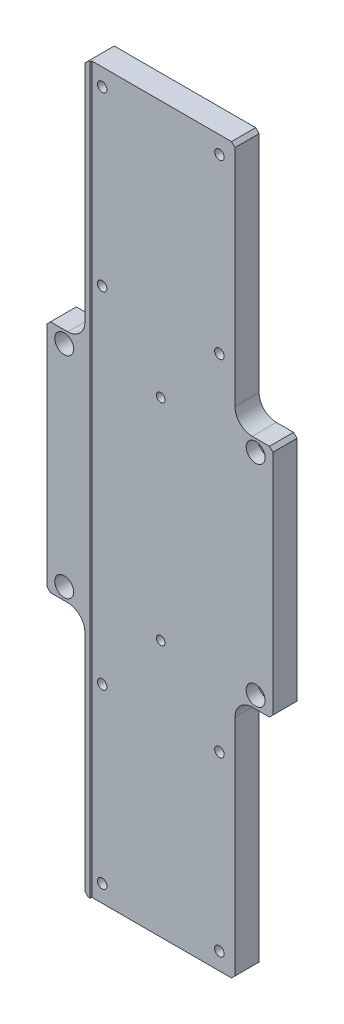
ISO-10303-21;
HEADER;
FILE_DESCRIPTION(('STEP AP214'),'2;1');
FILE_NAME('part.step','',(''),(''),'','','');
FILE_SCHEMA(('AUTOMOTIVE_DESIGN { 1 0 10303 214 1 1 1 1 }'));
ENDSEC;
DATA;
#1=APPLICATION_CONTEXT('core data for automotive mechanical design processes');
#2=APPLICATION_PROTOCOL_DEFINITION('international standard','automotive_design',2000,#1);
#3=PRODUCT_CONTEXT('',#1,'mechanical');
#4=PRODUCT('Part','Part','',(#3));
#5=PRODUCT_RELATED_PRODUCT_CATEGORY('part','',(#4));
#6=PRODUCT_DEFINITION_FORMATION('','',#4);
#7=PRODUCT_DEFINITION_CONTEXT('part definition',#1,'design');
#8=PRODUCT_DEFINITION('design','',#6,#7);
#9=PRODUCT_DEFINITION_SHAPE('','',#8);
#10=(LENGTH_UNIT() NAMED_UNIT(*) SI_UNIT(.MILLI.,.METRE.));
#11=(NAMED_UNIT(*) PLANE_ANGLE_UNIT() SI_UNIT($,.RADIAN.));
#12=(NAMED_UNIT(*) SI_UNIT($,.STERADIAN.) SOLID_ANGLE_UNIT());
#13=UNCERTAINTY_MEASURE_WITH_UNIT(LENGTH_MEASURE(1.E-05),#10,'distance_accuracy_value','');
#14=(GEOMETRIC_REPRESENTATION_CONTEXT(3) GLOBAL_UNCERTAINTY_ASSIGNED_CONTEXT((#13)) GLOBAL_UNIT_ASSIGNED_CONTEXT((#10,
#11,#12)) REPRESENTATION_CONTEXT('',''));
#15=CARTESIAN_POINT('',(0.,0.,0.));
#16=DIRECTION('',(0.,0.,1.));
#17=DIRECTION('',(1.,0.,0.));
#18=AXIS2_PLACEMENT_3D('',#15,#16,#17);
#19=CARTESIAN_POINT('',(0.,0.,-7.5));
#20=DIRECTION('',(0.,0.,1.));
#21=DIRECTION('',(1.,0.,0.));
#22=AXIS2_PLACEMENT_3D('',#19,#20,#21);
#23=PLANE('',#22);
#24=CARTESIAN_POINT('',(-34.,-100.,-7.5));
#25=DIRECTION('',(0.,0.,-1.));
#26=DIRECTION('',(-1.,0.,0.));
#27=AXIS2_PLACEMENT_3D('',#24,#25,#26);
#28=CIRCLE('',#27,4.75);
#29=CARTESIAN_POINT('',(-38.75,-100.,-7.5));
#30=VERTEX_POINT('',#29);
#31=EDGE_CURVE('E1316',#30,#30,#28,.T.);
#32=ORIENTED_EDGE('',*,*,#31,.F.);
#33=EDGE_LOOP('',(#32));
#34=FACE_BOUND('',#33,.T.);
#35=CARTESIAN_POINT('',(34.,-200.,-7.5));
#36=DIRECTION('',(0.,0.,-1.));
#37=DIRECTION('',(-1.,0.,0.));
#38=AXIS2_PLACEMENT_3D('',#35,#36,#37);
#39=CIRCLE('',#38,4.75);
#40=CARTESIAN_POINT('',(29.25,-200.,-7.5));
#41=VERTEX_POINT('',#40);
#42=EDGE_CURVE('E1304',#41,#41,#39,.T.);
#43=ORIENTED_EDGE('',*,*,#42,.F.);
#44=EDGE_LOOP('',(#43));
#45=FACE_BOUND('',#44,.T.);
#46=CARTESIAN_POINT('',(-34.,-200.,-7.5));
#47=DIRECTION('',(0.,0.,-1.));
#48=DIRECTION('',(-1.,0.,0.));
#49=AXIS2_PLACEMENT_3D('',#46,#47,#48);
#50=CIRCLE('',#49,4.75);
#51=CARTESIAN_POINT('',(-38.75,-200.,-7.5));
#52=VERTEX_POINT('',#51);
#53=EDGE_CURVE('E1292',#52,#52,#50,.T.);
#54=ORIENTED_EDGE('',*,*,#53,.F.);
#55=EDGE_LOOP('',(#54));
#56=FACE_BOUND('',#55,.T.);
#57=CARTESIAN_POINT('',(34.,-100.,-7.5));
#58=DIRECTION('',(0.,0.,-1.));
#59=DIRECTION('',(-1.,0.,0.));
#60=AXIS2_PLACEMENT_3D('',#57,#58,#59);
#61=CIRCLE('',#60,4.75);
#62=CARTESIAN_POINT('',(29.25,-100.,-7.5));
#63=VERTEX_POINT('',#62);
#64=EDGE_CURVE('E1280',#63,#63,#61,.T.);
#65=ORIENTED_EDGE('',*,*,#64,.F.);
#66=EDGE_LOOP('',(#65));
#67=FACE_BOUND('',#66,.T.);
#68=CARTESIAN_POINT('',(34.,99.9999999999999,-7.5));
#69=DIRECTION('',(0.,0.,-1.));
#70=DIRECTION('',(-1.,0.,0.));
#71=AXIS2_PLACEMENT_3D('',#68,#69,#70);
#72=CIRCLE('',#71,4.75);
#73=CARTESIAN_POINT('',(29.25,99.9999999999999,-7.5));
#74=VERTEX_POINT('',#73);
#75=EDGE_CURVE('E322',#74,#74,#72,.T.);
#76=ORIENTED_EDGE('',*,*,#75,.F.);
#77=EDGE_LOOP('',(#76));
#78=FACE_BOUND('',#77,.T.);
#79=CARTESIAN_POINT('',(-34.,99.9999999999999,-7.5));
#80=DIRECTION('',(0.,0.,-1.));
#81=DIRECTION('',(-1.,0.,0.));
#82=AXIS2_PLACEMENT_3D('',#79,#80,#81);
#83=CIRCLE('',#82,4.75);
#84=CARTESIAN_POINT('',(-38.75,99.9999999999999,-7.5));
#85=VERTEX_POINT('',#84);
#86=EDGE_CURVE('E317',#85,#85,#83,.T.);
#87=ORIENTED_EDGE('',*,*,#86,.F.);
#88=EDGE_LOOP('',(#87));
#89=FACE_BOUND('',#88,.T.);
#90=CARTESIAN_POINT('',(-55.,60.9999999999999,-7.5));
#91=DIRECTION('',(0.,0.,1.));
#92=DIRECTION('',(1.,0.,0.));
#93=AXIS2_PLACEMENT_3D('',#90,#91,#92);
#94=CIRCLE('',#93,3.3);
#95=CARTESIAN_POINT('',(-51.7,60.9999999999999,-7.5));
#96=VERTEX_POINT('',#95);
#97=EDGE_CURVE('E1167',#96,#96,#94,.T.);
#98=ORIENTED_EDGE('',*,*,#97,.T.);
#99=EDGE_LOOP('',(#98));
#100=FACE_BOUND('',#99,.T.);
#101=CARTESIAN_POINT('',(-55.,-61.0000000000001,-7.5));
#102=DIRECTION('',(0.,0.,1.));
#103=DIRECTION('',(1.,0.,0.));
#104=AXIS2_PLACEMENT_3D('',#101,#102,#103);
#105=CIRCLE('',#104,3.3);
#106=CARTESIAN_POINT('',(-51.7,-61.0000000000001,-7.5));
#107=VERTEX_POINT('',#106);
#108=EDGE_CURVE('E1179',#107,#107,#105,.T.);
#109=ORIENTED_EDGE('',*,*,#108,.T.);
#110=EDGE_LOOP('',(#109));
#111=FACE_BOUND('',#110,.T.);
#112=CARTESIAN_POINT('',(55.,60.9999999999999,-7.5));
#113=DIRECTION('',(0.,0.,1.));
#114=DIRECTION('',(1.,0.,0.));
#115=AXIS2_PLACEMENT_3D('',#112,#113,#114);
#116=CIRCLE('',#115,3.3);
#117=CARTESIAN_POINT('',(58.3,60.9999999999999,-7.5));
#118=VERTEX_POINT('',#117);
#119=EDGE_CURVE('E308',#118,#118,#116,.T.);
#120=ORIENTED_EDGE('',*,*,#119,.T.);
#121=EDGE_LOOP('',(#120));
#122=FACE_BOUND('',#121,.T.);
#123=CARTESIAN_POINT('',(55.,-61.0000000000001,-7.5));
#124=DIRECTION('',(0.,0.,1.));
#125=DIRECTION('',(1.,0.,0.));
#126=AXIS2_PLACEMENT_3D('',#123,#124,#125);
#127=CIRCLE('',#126,3.3);
#128=CARTESIAN_POINT('',(58.3,-61.0000000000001,-7.5));
#129=VERTEX_POINT('',#128);
#130=EDGE_CURVE('E303',#129,#129,#127,.T.);
#131=ORIENTED_EDGE('',*,*,#130,.T.);
#132=EDGE_LOOP('',(#131));
#133=FACE_BOUND('',#132,.T.);
#134=CARTESIAN_POINT('',(0.,60.9999999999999,-7.5));
#135=DIRECTION('',(0.,0.,1.));
#136=DIRECTION('',(1.,0.,0.));
#137=AXIS2_PLACEMENT_3D('',#134,#135,#136);
#138=CIRCLE('',#137,2.5);
#139=CARTESIAN_POINT('',(2.5,60.9999999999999,-7.5));
#140=VERTEX_POINT('',#139);
#141=EDGE_CURVE('E1199',#140,#140,#138,.T.);
#142=ORIENTED_EDGE('',*,*,#141,.T.);
#143=EDGE_LOOP('',(#142));
#144=FACE_BOUND('',#143,.T.);
#145=CARTESIAN_POINT('',(0.,-61.0000000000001,-7.5));
#146=DIRECTION('',(0.,0.,1.));
#147=DIRECTION('',(1.,0.,0.));
#148=AXIS2_PLACEMENT_3D('',#145,#146,#147);
#149=CIRCLE('',#148,2.5);
#150=CARTESIAN_POINT('',(2.5,-61.0000000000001,-7.5));
#151=VERTEX_POINT('',#150);
#152=EDGE_CURVE('E238',#151,#151,#149,.T.);
#153=ORIENTED_EDGE('',*,*,#152,.T.);
#154=EDGE_LOOP('',(#153));
#155=FACE_BOUND('',#154,.T.);
#156=DIRECTION('',(0.,-1.,0.));
#157=VECTOR('',#156,1.);
#158=CARTESIAN_POINT('',(-65.,0.,-7.5));
#159=LINE('',#158,#157);
#160=CARTESIAN_POINT('',(-65.,65.9999999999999,-7.5));
#161=VERTEX_POINT('',#160);
#162=CARTESIAN_POINT('',(-65.,-66.0000000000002,-7.5));
#163=VERTEX_POINT('',#162);
#164=EDGE_CURVE('E275',#161,#163,#159,.T.);
#165=ORIENTED_EDGE('',*,*,#164,.F.);
#166=DIRECTION('',(0.707106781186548,0.707106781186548,0.));
#167=VECTOR('',#166,1.);
#168=CARTESIAN_POINT('',(-65.,65.9999999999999,-7.5));
#169=LINE('',#168,#167);
#170=CARTESIAN_POINT('',(-62.9999999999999,67.9999999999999,-7.5));
#171=VERTEX_POINT('',#170);
#172=EDGE_CURVE('E389',#161,#171,#169,.T.);
#173=ORIENTED_EDGE('',*,*,#172,.T.);
#174=DIRECTION('',(1.,0.,0.));
#175=VECTOR('',#174,1.);
#176=CARTESIAN_POINT('',(0.,67.9999999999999,-7.5));
#177=LINE('',#176,#175);
#178=CARTESIAN_POINT('',(-53.,67.9999999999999,-7.5));
#179=VERTEX_POINT('',#178);
#180=EDGE_CURVE('E273',#171,#179,#177,.T.);
#181=ORIENTED_EDGE('',*,*,#180,.T.);
#182=CARTESIAN_POINT('',(-53.,77.9999999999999,-7.5));
#183=DIRECTION('',(0.,0.,1.));
#184=DIRECTION('',(1.,0.,0.));
#185=AXIS2_PLACEMENT_3D('',#182,#183,#184);
#186=CIRCLE('',#185,10.);
#187=CARTESIAN_POINT('',(-43.,77.9999999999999,-7.5));
#188=VERTEX_POINT('',#187);
#189=EDGE_CURVE('E350',#179,#188,#186,.T.);
#190=ORIENTED_EDGE('',*,*,#189,.T.);
#191=DIRECTION('',(0.,-1.,0.));
#192=VECTOR('',#191,1.);
#193=CARTESIAN_POINT('',(-43.,0.,-7.5));
#194=LINE('',#193,#192);
#195=CARTESIAN_POINT('',(-43.,208.,-7.5));
#196=VERTEX_POINT('',#195);
#197=EDGE_CURVE('E271',#196,#188,#194,.T.);
#198=ORIENTED_EDGE('',*,*,#197,.F.);
#199=DIRECTION('',(0.707106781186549,0.707106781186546,0.));
#200=VECTOR('',#199,1.);
#201=CARTESIAN_POINT('',(-43.,208.,-7.5));
#202=LINE('',#201,#200);
#203=CARTESIAN_POINT('',(-41.0000000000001,210.,-7.5));
#204=VERTEX_POINT('',#203);
#205=EDGE_CURVE('E377',#196,#204,#202,.T.);
#206=ORIENTED_EDGE('',*,*,#205,.T.);
#207=DIRECTION('',(1.,0.,0.));
#208=VECTOR('',#207,1.);
#209=CARTESIAN_POINT('',(0.,210.,-7.5));
#210=LINE('',#209,#208);
#211=CARTESIAN_POINT('',(41.,210.,-7.5));
#212=VERTEX_POINT('',#211);
#213=EDGE_CURVE('E268',#204,#212,#210,.T.);
#214=ORIENTED_EDGE('',*,*,#213,.T.);
#215=DIRECTION('',(-0.707106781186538,0.707106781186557,0.));
#216=VECTOR('',#215,1.);
#217=CARTESIAN_POINT('',(41.,210.,-7.5));
#218=LINE('',#217,#216);
#219=CARTESIAN_POINT('',(43.,208.,-7.5));
#220=VERTEX_POINT('',#219);
#221=EDGE_CURVE('E375',#212,#220,#218,.F.);
#222=ORIENTED_EDGE('',*,*,#221,.T.);
#223=DIRECTION('',(0.,-1.,0.));
#224=VECTOR('',#223,1.);
#225=CARTESIAN_POINT('',(43.,0.,-7.5));
#226=LINE('',#225,#224);
#227=CARTESIAN_POINT('',(43.,77.9999999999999,-7.5));
#228=VERTEX_POINT('',#227);
#229=EDGE_CURVE('E248',#220,#228,#226,.T.);
#230=ORIENTED_EDGE('',*,*,#229,.T.);
#231=CARTESIAN_POINT('',(53.,77.9999999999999,-7.5));
#232=DIRECTION('',(0.,0.,1.));
#233=DIRECTION('',(1.,0.,0.));
#234=AXIS2_PLACEMENT_3D('',#231,#232,#233);
#235=CIRCLE('',#234,10.);
#236=CARTESIAN_POINT('',(53.,67.9999999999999,-7.5));
#237=VERTEX_POINT('',#236);
#238=EDGE_CURVE('E356',#228,#237,#235,.T.);
#239=ORIENTED_EDGE('',*,*,#238,.T.);
#240=DIRECTION('',(1.,0.,0.));
#241=VECTOR('',#240,1.);
#242=CARTESIAN_POINT('',(0.,67.9999999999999,-7.5));
#243=LINE('',#242,#241);
#244=CARTESIAN_POINT('',(62.9999999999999,67.9999999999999,-7.5));
#245=VERTEX_POINT('',#244);
#246=EDGE_CURVE('E252',#237,#245,#243,.T.);
#247=ORIENTED_EDGE('',*,*,#246,.T.);
#248=DIRECTION('',(-0.707106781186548,0.707106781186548,0.));
#249=VECTOR('',#248,1.);
#250=CARTESIAN_POINT('',(62.9999999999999,67.9999999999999,-7.5));
#251=LINE('',#250,#249);
#252=CARTESIAN_POINT('',(65.,65.9999999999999,-7.5));
#253=VERTEX_POINT('',#252);
#254=EDGE_CURVE('E379',#245,#253,#251,.F.);
#255=ORIENTED_EDGE('',*,*,#254,.T.);
#256=DIRECTION('',(0.,-1.,0.));
#257=VECTOR('',#256,1.);
#258=CARTESIAN_POINT('',(65.,0.,-7.5));
#259=LINE('',#258,#257);
#260=CARTESIAN_POINT('',(65.,-66.,-7.5));
#261=VERTEX_POINT('',#260);
#262=EDGE_CURVE('E291',#253,#261,#259,.T.);
#263=ORIENTED_EDGE('',*,*,#262,.T.);
#264=DIRECTION('',(-0.70710678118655,-0.707106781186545,0.));
#265=VECTOR('',#264,1.);
#266=CARTESIAN_POINT('',(65.,-66.,-7.5));
#267=LINE('',#266,#265);
#268=CARTESIAN_POINT('',(62.9999999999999,-68.0000000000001,-7.5));
#269=VERTEX_POINT('',#268);
#270=EDGE_CURVE('E381',#261,#269,#267,.T.);
#271=ORIENTED_EDGE('',*,*,#270,.T.);
#272=DIRECTION('',(1.,0.,0.));
#273=VECTOR('',#272,1.);
#274=CARTESIAN_POINT('',(0.,-68.0000000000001,-7.5));
#275=LINE('',#274,#273);
#276=CARTESIAN_POINT('',(53.,-68.0000000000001,-7.5));
#277=VERTEX_POINT('',#276);
#278=EDGE_CURVE('E288',#277,#269,#275,.T.);
#279=ORIENTED_EDGE('',*,*,#278,.F.);
#280=CARTESIAN_POINT('',(53.,-78.0000000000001,-7.5));
#281=DIRECTION('',(0.,0.,1.));
#282=DIRECTION('',(1.,0.,0.));
#283=AXIS2_PLACEMENT_3D('',#280,#281,#282);
#284=CIRCLE('',#283,10.);
#285=CARTESIAN_POINT('',(43.,-78.0000000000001,-7.5));
#286=VERTEX_POINT('',#285);
#287=EDGE_CURVE('E361',#277,#286,#284,.T.);
#288=ORIENTED_EDGE('',*,*,#287,.T.);
#289=DIRECTION('',(0.,-1.,0.));
#290=VECTOR('',#289,1.);
#291=CARTESIAN_POINT('',(43.,0.,-7.5));
#292=LINE('',#291,#290);
#293=CARTESIAN_POINT('',(43.,-208.,-7.5));
#294=VERTEX_POINT('',#293);
#295=EDGE_CURVE('E285',#286,#294,#292,.T.);
#296=ORIENTED_EDGE('',*,*,#295,.T.);
#297=DIRECTION('',(-0.707106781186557,-0.707106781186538,0.));
#298=VECTOR('',#297,1.);
#299=CARTESIAN_POINT('',(43.,-208.,-7.5));
#300=LINE('',#299,#298);
#301=CARTESIAN_POINT('',(41.0000000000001,-210.,-7.5));
#302=VERTEX_POINT('',#301);
#303=EDGE_CURVE('E383',#294,#302,#300,.T.);
#304=ORIENTED_EDGE('',*,*,#303,.T.);
#305=DIRECTION('',(1.,0.,0.));
#306=VECTOR('',#305,1.);
#307=CARTESIAN_POINT('',(0.,-210.,-7.5));
#308=LINE('',#307,#306);
#309=CARTESIAN_POINT('',(-41.,-210.,-7.5));
#310=VERTEX_POINT('',#309);
#311=EDGE_CURVE('E283',#310,#302,#308,.T.);
#312=ORIENTED_EDGE('',*,*,#311,.F.);
#313=DIRECTION('',(0.707106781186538,-0.707106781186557,0.));
#314=VECTOR('',#313,1.);
#315=CARTESIAN_POINT('',(-41.,-210.,-7.5));
#316=LINE('',#315,#314);
#317=CARTESIAN_POINT('',(-43.,-208.,-7.5));
#318=VERTEX_POINT('',#317);
#319=EDGE_CURVE('E385',#310,#318,#316,.F.);
#320=ORIENTED_EDGE('',*,*,#319,.T.);
#321=DIRECTION('',(0.,-1.,0.));
#322=VECTOR('',#321,1.);
#323=CARTESIAN_POINT('',(-43.,0.,-7.5));
#324=LINE('',#323,#322);
#325=CARTESIAN_POINT('',(-43.,-78.0000000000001,-7.5));
#326=VERTEX_POINT('',#325);
#327=EDGE_CURVE('E280',#326,#318,#324,.T.);
#328=ORIENTED_EDGE('',*,*,#327,.F.);
#329=CARTESIAN_POINT('',(-53.,-78.0000000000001,-7.5));
#330=DIRECTION('',(0.,0.,1.));
#331=DIRECTION('',(1.,0.,0.));
#332=AXIS2_PLACEMENT_3D('',#329,#330,#331);
#333=CIRCLE('',#332,10.);
#334=CARTESIAN_POINT('',(-53.,-68.0000000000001,-7.5));
#335=VERTEX_POINT('',#334);
#336=EDGE_CURVE('E365',#326,#335,#333,.T.);
#337=ORIENTED_EDGE('',*,*,#336,.T.);
#338=DIRECTION('',(1.,0.,0.));
#339=VECTOR('',#338,1.);
#340=CARTESIAN_POINT('',(0.,-68.0000000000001,-7.5));
#341=LINE('',#340,#339);
#342=CARTESIAN_POINT('',(-63.,-68.0000000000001,-7.5));
#343=VERTEX_POINT('',#342);
#344=EDGE_CURVE('E278',#343,#335,#341,.T.);
#345=ORIENTED_EDGE('',*,*,#344,.F.);
#346=DIRECTION('',(0.70710678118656,-0.707106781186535,0.));
#347=VECTOR('',#346,1.);
#348=CARTESIAN_POINT('',(-63.,-68.0000000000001,-7.5));
#349=LINE('',#348,#347);
#350=EDGE_CURVE('E387',#343,#163,#349,.F.);
#351=ORIENTED_EDGE('',*,*,#350,.T.);
#352=EDGE_LOOP('',(#165,#173,#181,#190,#198,#206,#214,#222,#230,#239,#247,#255,#263,#271,#279,
#288,#296,#304,#312,#320,#328,#337,#345,#351));
#353=FACE_BOUND('',#352,.T.);
#354=CARTESIAN_POINT('',(-34.,200.,-7.5));
#355=DIRECTION('',(0.,0.,-1.));
#356=DIRECTION('',(-1.,0.,0.));
#357=AXIS2_PLACEMENT_3D('',#354,#355,#356);
#358=CIRCLE('',#357,4.75);
#359=CARTESIAN_POINT('',(-38.75,200.,-7.5));
#360=VERTEX_POINT('',#359);
#361=EDGE_CURVE('E327',#360,#360,#358,.T.);
#362=ORIENTED_EDGE('',*,*,#361,.F.);
#363=EDGE_LOOP('',(#362));
#364=FACE_BOUND('',#363,.T.);
#365=CARTESIAN_POINT('',(34.,200.,-7.5));
#366=DIRECTION('',(0.,0.,-1.));
#367=DIRECTION('',(-1.,0.,0.));
#368=AXIS2_PLACEMENT_3D('',#365,#366,#367);
#369=CIRCLE('',#368,4.75);
#370=CARTESIAN_POINT('',(29.25,200.,-7.5));
#371=VERTEX_POINT('',#370);
#372=EDGE_CURVE('E1268',#371,#371,#369,.T.);
#373=ORIENTED_EDGE('',*,*,#372,.F.);
#374=EDGE_LOOP('',(#373));
#375=FACE_BOUND('',#374,.T.);
#376=ADVANCED_FACE('F34',(#34,#45,#56,#67,#78,#89,#100,#111,#122,#133,#144,#155,#353,#364,#375),
#23,.F.);
#377=CARTESIAN_POINT('',(43.,0.,7.5));
#378=DIRECTION('',(1.,0.,0.));
#379=DIRECTION('',(0.,1.,0.));
#380=AXIS2_PLACEMENT_3D('',#377,#378,#379);
#381=PLANE('',#380);
#382=ORIENTED_EDGE('',*,*,#229,.F.);
#383=DIRECTION('',(0.,0.,1.));
#384=VECTOR('',#383,1.);
#385=CARTESIAN_POINT('',(43.,208.,7.5));
#386=LINE('',#385,#384);
#387=CARTESIAN_POINT('',(43.,208.,6.5));
#388=VERTEX_POINT('',#387);
#389=EDGE_CURVE('E11',#220,#388,#386,.T.);
#390=ORIENTED_EDGE('',*,*,#389,.T.);
#391=DIRECTION('',(0.,-1.,0.));
#392=VECTOR('',#391,1.);
#393=CARTESIAN_POINT('',(43.,0.,6.5));
#394=LINE('',#393,#392);
#395=CARTESIAN_POINT('',(43.,77.9999999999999,6.5));
#396=VERTEX_POINT('',#395);
#397=EDGE_CURVE('E239',#388,#396,#394,.T.);
#398=ORIENTED_EDGE('',*,*,#397,.T.);
#399=DIRECTION('',(0.,0.,-1.));
#400=VECTOR('',#399,1.);
#401=CARTESIAN_POINT('',(43.,77.9999999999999,-7.5));
#402=LINE('',#401,#400);
#403=EDGE_CURVE('E334',#396,#228,#402,.T.);
#404=ORIENTED_EDGE('',*,*,#403,.T.);
#405=EDGE_LOOP('',(#382,#390,#398,#404));
#406=FACE_BOUND('',#405,.T.);
#407=ADVANCED_FACE('F534',(#406),#381,.T.);
#408=CARTESIAN_POINT('',(43.,0.,7.5));
#409=DIRECTION('',(1.,0.,0.));
#410=DIRECTION('',(0.,1.,0.));
#411=AXIS2_PLACEMENT_3D('',#408,#409,#410);
#412=PLANE('',#411);
#413=DIRECTION('',(0.,-1.,0.));
#414=VECTOR('',#413,1.);
#415=CARTESIAN_POINT('',(43.,0.,6.5));
#416=LINE('',#415,#414);
#417=CARTESIAN_POINT('',(43.,-78.0000000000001,6.5));
#418=VERTEX_POINT('',#417);
#419=CARTESIAN_POINT('',(43.,-208.,6.5));
#420=VERTEX_POINT('',#419);
#421=EDGE_CURVE('E245',#418,#420,#416,.T.);
#422=ORIENTED_EDGE('',*,*,#421,.T.);
#423=DIRECTION('',(0.,0.,-1.));
#424=VECTOR('',#423,1.);
#425=CARTESIAN_POINT('',(43.,-208.,-7.5));
#426=LINE('',#425,#424);
#427=EDGE_CURVE('E410',#420,#294,#426,.T.);
#428=ORIENTED_EDGE('',*,*,#427,.T.);
#429=ORIENTED_EDGE('',*,*,#295,.F.);
#430=DIRECTION('',(0.,0.,-1.));
#431=VECTOR('',#430,1.);
#432=CARTESIAN_POINT('',(43.,-78.0000000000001,7.5));
#433=LINE('',#432,#431);
#434=EDGE_CURVE('E342',#286,#418,#433,.F.);
#435=ORIENTED_EDGE('',*,*,#434,.T.);
#436=EDGE_LOOP('',(#422,#428,#429,#435));
#437=FACE_BOUND('',#436,.T.);
#438=ADVANCED_FACE('F499',(#437),#412,.T.);
#439=CARTESIAN_POINT('',(0.,-68.0000000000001,7.5));
#440=DIRECTION('',(0.,1.,0.));
#441=DIRECTION('',(0.,0.,1.));
#442=AXIS2_PLACEMENT_3D('',#439,#440,#441);
#443=PLANE('',#442);
#444=ORIENTED_EDGE('',*,*,#278,.T.);
#445=DIRECTION('',(0.,0.,1.));
#446=VECTOR('',#445,1.);
#447=CARTESIAN_POINT('',(62.9999999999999,-68.0000000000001,6.5));
#448=LINE('',#447,#446);
#449=CARTESIAN_POINT('',(62.9999999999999,-68.0000000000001,6.5));
#450=VERTEX_POINT('',#449);
#451=EDGE_CURVE('E425',#269,#450,#448,.T.);
#452=ORIENTED_EDGE('',*,*,#451,.T.);
#453=DIRECTION('',(1.,0.,0.));
#454=VECTOR('',#453,1.);
#455=CARTESIAN_POINT('',(0.,-68.0000000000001,6.5));
#456=LINE('',#455,#454);
#457=CARTESIAN_POINT('',(53.,-68.0000000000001,6.5));
#458=VERTEX_POINT('',#457);
#459=EDGE_CURVE('E242',#458,#450,#456,.T.);
#460=ORIENTED_EDGE('',*,*,#459,.F.);
#461=DIRECTION('',(0.,0.,-1.));
#462=VECTOR('',#461,1.);
#463=CARTESIAN_POINT('',(53.,-68.0000000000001,7.5));
#464=LINE('',#463,#462);
#465=EDGE_CURVE('E339',#458,#277,#464,.T.);
#466=ORIENTED_EDGE('',*,*,#465,.T.);
#467=EDGE_LOOP('',(#444,#452,#460,#466));
#468=FACE_BOUND('',#467,.T.);
#469=ADVANCED_FACE('F509',(#468),#443,.F.);
#470=CARTESIAN_POINT('',(65.,0.,7.5));
#471=DIRECTION('',(1.,0.,0.));
#472=DIRECTION('',(0.,1.,0.));
#473=AXIS2_PLACEMENT_3D('',#470,#471,#472);
#474=PLANE('',#473);
#475=DIRECTION('',(0.,1.,0.));
#476=VECTOR('',#475,1.);
#477=CARTESIAN_POINT('',(65.,210.,6.5));
#478=LINE('',#477,#476);
#479=CARTESIAN_POINT('',(65.,-66.,6.5));
#480=VERTEX_POINT('',#479);
#481=CARTESIAN_POINT('',(65.,65.9999999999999,6.5));
#482=VERTEX_POINT('',#481);
#483=EDGE_CURVE('E230',#480,#482,#478,.T.);
#484=ORIENTED_EDGE('',*,*,#483,.F.);
#485=DIRECTION('',(0.,0.,-1.));
#486=VECTOR('',#485,1.);
#487=CARTESIAN_POINT('',(65.,-66.,-7.5));
#488=LINE('',#487,#486);
#489=EDGE_CURVE('E422',#480,#261,#488,.T.);
#490=ORIENTED_EDGE('',*,*,#489,.T.);
#491=ORIENTED_EDGE('',*,*,#262,.F.);
#492=DIRECTION('',(0.,0.,1.));
#493=VECTOR('',#492,1.);
#494=CARTESIAN_POINT('',(65.,65.9999999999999,7.5));
#495=LINE('',#494,#493);
#496=EDGE_CURVE('E420',#253,#482,#495,.T.);
#497=ORIENTED_EDGE('',*,*,#496,.T.);
#498=EDGE_LOOP('',(#484,#490,#491,#497));
#499=FACE_BOUND('',#498,.T.);
#500=ADVANCED_FACE('F518',(#499),#474,.T.);
#501=CARTESIAN_POINT('',(0.,67.9999999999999,7.5));
#502=DIRECTION('',(0.,1.,0.));
#503=DIRECTION('',(0.,0.,1.));
#504=AXIS2_PLACEMENT_3D('',#501,#502,#503);
#505=PLANE('',#504);
#506=DIRECTION('',(1.,0.,0.));
#507=VECTOR('',#506,1.);
#508=CARTESIAN_POINT('',(0.,67.9999999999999,6.5));
#509=LINE('',#508,#507);
#510=CARTESIAN_POINT('',(53.,67.9999999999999,6.5));
#511=VERTEX_POINT('',#510);
#512=CARTESIAN_POINT('',(62.9999999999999,67.9999999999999,6.5));
#513=VERTEX_POINT('',#512);
#514=EDGE_CURVE('E266',#511,#513,#509,.T.);
#515=ORIENTED_EDGE('',*,*,#514,.T.);
#516=DIRECTION('',(0.,0.,-1.));
#517=VECTOR('',#516,1.);
#518=CARTESIAN_POINT('',(62.9999999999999,67.9999999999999,7.5));
#519=LINE('',#518,#517);
#520=EDGE_CURVE('E427',#513,#245,#519,.T.);
#521=ORIENTED_EDGE('',*,*,#520,.T.);
#522=ORIENTED_EDGE('',*,*,#246,.F.);
#523=DIRECTION('',(0.,0.,-1.));
#524=VECTOR('',#523,1.);
#525=CARTESIAN_POINT('',(53.,67.9999999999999,6.5));
#526=LINE('',#525,#524);
#527=EDGE_CURVE('E337',#237,#511,#526,.F.);
#528=ORIENTED_EDGE('',*,*,#527,.T.);
#529=EDGE_LOOP('',(#515,#521,#522,#528));
#530=FACE_BOUND('',#529,.T.);
#531=ADVANCED_FACE('F527',(#530),#505,.T.);
#532=CARTESIAN_POINT('',(0.,210.,7.5));
#533=DIRECTION('',(0.,1.,0.));
#534=DIRECTION('',(0.,0.,1.));
#535=AXIS2_PLACEMENT_3D('',#532,#533,#534);
#536=PLANE('',#535);
#537=ORIENTED_EDGE('',*,*,#213,.F.);
#538=DIRECTION('',(0.,0.,1.));
#539=VECTOR('',#538,1.);
#540=CARTESIAN_POINT('',(-41.0000000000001,210.,7.5));
#541=LINE('',#540,#539);
#542=CARTESIAN_POINT('',(-41.0000000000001,210.,7.5));
#543=VERTEX_POINT('',#542);
#544=EDGE_CURVE('E42',#204,#543,#541,.T.);
#545=ORIENTED_EDGE('',*,*,#544,.T.);
#546=DIRECTION('',(1.,0.,0.));
#547=VECTOR('',#546,1.);
#548=CARTESIAN_POINT('',(0.,210.,7.5));
#549=LINE('',#548,#547);
#550=CARTESIAN_POINT('',(-40.,210.,7.5));
#551=VERTEX_POINT('',#550);
#552=EDGE_CURVE('E249',#543,#551,#549,.T.);
#553=ORIENTED_EDGE('',*,*,#552,.T.);
#554=DIRECTION('',(0.,0.,1.));
#555=VECTOR('',#554,1.);
#556=CARTESIAN_POINT('',(-40.,210.,6.5));
#557=LINE('',#556,#555);
#558=CARTESIAN_POINT('',(-40.,210.,6.5));
#559=VERTEX_POINT('',#558);
#560=EDGE_CURVE('E218',#559,#551,#557,.T.);
#561=ORIENTED_EDGE('',*,*,#560,.F.);
#562=DIRECTION('',(-1.,0.,0.));
#563=VECTOR('',#562,1.);
#564=CARTESIAN_POINT('',(-40.,210.,6.5));
#565=LINE('',#564,#563);
#566=CARTESIAN_POINT('',(41.,210.,6.5));
#567=VERTEX_POINT('',#566);
#568=EDGE_CURVE('E219',#567,#559,#565,.T.);
#569=ORIENTED_EDGE('',*,*,#568,.F.);
#570=DIRECTION('',(0.,0.,-1.));
#571=VECTOR('',#570,1.);
#572=CARTESIAN_POINT('',(41.,210.,7.5));
#573=LINE('',#572,#571);
#574=EDGE_CURVE('E433',#567,#212,#573,.T.);
#575=ORIENTED_EDGE('',*,*,#574,.T.);
#576=EDGE_LOOP('',(#537,#545,#553,#561,#569,#575));
#577=FACE_BOUND('',#576,.T.);
#578=ADVANCED_FACE('F439',(#577),#536,.T.);
#579=CARTESIAN_POINT('',(-43.,0.,7.5));
#580=DIRECTION('',(1.,0.,0.));
#581=DIRECTION('',(0.,1.,0.));
#582=AXIS2_PLACEMENT_3D('',#579,#580,#581);
#583=PLANE('',#582);
#584=DIRECTION('',(0.,-1.,0.));
#585=VECTOR('',#584,1.);
#586=CARTESIAN_POINT('',(-43.,0.,7.5));
#587=LINE('',#586,#585);
#588=CARTESIAN_POINT('',(-43.,208.,7.5));
#589=VERTEX_POINT('',#588);
#590=CARTESIAN_POINT('',(-43.,77.9999999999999,7.5));
#591=VERTEX_POINT('',#590);
#592=EDGE_CURVE('E251',#589,#591,#587,.T.);
#593=ORIENTED_EDGE('',*,*,#592,.F.);
#594=DIRECTION('',(0.,0.,-1.));
#595=VECTOR('',#594,1.);
#596=CARTESIAN_POINT('',(-43.,208.,-7.5));
#597=LINE('',#596,#595);
#598=EDGE_CURVE('E430',#589,#196,#597,.T.);
#599=ORIENTED_EDGE('',*,*,#598,.T.);
#600=ORIENTED_EDGE('',*,*,#197,.T.);
#601=DIRECTION('',(0.,0.,-1.));
#602=VECTOR('',#601,1.);
#603=CARTESIAN_POINT('',(-43.,77.9999999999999,7.5));
#604=LINE('',#603,#602);
#605=EDGE_CURVE('E331',#188,#591,#604,.F.);
#606=ORIENTED_EDGE('',*,*,#605,.T.);
#607=EDGE_LOOP('',(#593,#599,#600,#606));
#608=FACE_BOUND('',#607,.T.);
#609=ADVANCED_FACE('F450',(#608),#583,.F.);
#610=CARTESIAN_POINT('',(0.,67.9999999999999,7.5));
#611=DIRECTION('',(0.,1.,0.));
#612=DIRECTION('',(0.,0.,1.));
#613=AXIS2_PLACEMENT_3D('',#610,#611,#612);
#614=PLANE('',#613);
#615=ORIENTED_EDGE('',*,*,#180,.F.);
#616=DIRECTION('',(0.,0.,1.));
#617=VECTOR('',#616,1.);
#618=CARTESIAN_POINT('',(-62.9999999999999,67.9999999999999,7.5));
#619=LINE('',#618,#617);
#620=CARTESIAN_POINT('',(-62.9999999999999,67.9999999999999,7.5));
#621=VERTEX_POINT('',#620);
#622=EDGE_CURVE('E391',#171,#621,#619,.T.);
#623=ORIENTED_EDGE('',*,*,#622,.T.);
#624=DIRECTION('',(1.,0.,0.));
#625=VECTOR('',#624,1.);
#626=CARTESIAN_POINT('',(0.,67.9999999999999,7.5));
#627=LINE('',#626,#625);
#628=CARTESIAN_POINT('',(-53.,67.9999999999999,7.5));
#629=VERTEX_POINT('',#628);
#630=EDGE_CURVE('E254',#621,#629,#627,.T.);
#631=ORIENTED_EDGE('',*,*,#630,.T.);
#632=DIRECTION('',(0.,0.,-1.));
#633=VECTOR('',#632,1.);
#634=CARTESIAN_POINT('',(-53.,67.9999999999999,7.5));
#635=LINE('',#634,#633);
#636=EDGE_CURVE('E298',#629,#179,#635,.T.);
#637=ORIENTED_EDGE('',*,*,#636,.T.);
#638=EDGE_LOOP('',(#615,#623,#631,#637));
#639=FACE_BOUND('',#638,.T.);
#640=ADVANCED_FACE('F569',(#639),#614,.T.);
#641=CARTESIAN_POINT('',(-65.,0.,7.5));
#642=DIRECTION('',(1.,0.,0.));
#643=DIRECTION('',(0.,1.,0.));
#644=AXIS2_PLACEMENT_3D('',#641,#642,#643);
#645=PLANE('',#644);
#646=DIRECTION('',(0.,-1.,0.));
#647=VECTOR('',#646,1.);
#648=CARTESIAN_POINT('',(-65.,0.,7.5));
#649=LINE('',#648,#647);
#650=CARTESIAN_POINT('',(-65.,65.9999999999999,7.5));
#651=VERTEX_POINT('',#650);
#652=CARTESIAN_POINT('',(-65.,-66.0000000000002,7.5));
#653=VERTEX_POINT('',#652);
#654=EDGE_CURVE('E256',#651,#653,#649,.T.);
#655=ORIENTED_EDGE('',*,*,#654,.F.);
#656=DIRECTION('',(0.,0.,-1.));
#657=VECTOR('',#656,1.);
#658=CARTESIAN_POINT('',(-65.,65.9999999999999,-7.5));
#659=LINE('',#658,#657);
#660=EDGE_CURVE('E372',#651,#161,#659,.T.);
#661=ORIENTED_EDGE('',*,*,#660,.T.);
#662=ORIENTED_EDGE('',*,*,#164,.T.);
#663=DIRECTION('',(0.,0.,1.));
#664=VECTOR('',#663,1.);
#665=CARTESIAN_POINT('',(-65.,-66.0000000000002,7.5));
#666=LINE('',#665,#664);
#667=EDGE_CURVE('E370',#163,#653,#666,.T.);
#668=ORIENTED_EDGE('',*,*,#667,.T.);
#669=EDGE_LOOP('',(#655,#661,#662,#668));
#670=FACE_BOUND('',#669,.T.);
#671=ADVANCED_FACE('F469',(#670),#645,.F.);
#672=CARTESIAN_POINT('',(0.,-68.0000000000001,7.5));
#673=DIRECTION('',(0.,1.,0.));
#674=DIRECTION('',(0.,0.,1.));
#675=AXIS2_PLACEMENT_3D('',#672,#673,#674);
#676=PLANE('',#675);
#677=DIRECTION('',(1.,0.,0.));
#678=VECTOR('',#677,1.);
#679=CARTESIAN_POINT('',(0.,-68.0000000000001,7.5));
#680=LINE('',#679,#678);
#681=CARTESIAN_POINT('',(-63.,-68.0000000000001,7.5));
#682=VERTEX_POINT('',#681);
#683=CARTESIAN_POINT('',(-53.,-68.0000000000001,7.5));
#684=VERTEX_POINT('',#683);
#685=EDGE_CURVE('E259',#682,#684,#680,.T.);
#686=ORIENTED_EDGE('',*,*,#685,.F.);
#687=DIRECTION('',(0.,0.,-1.));
#688=VECTOR('',#687,1.);
#689=CARTESIAN_POINT('',(-63.,-68.0000000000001,7.5));
#690=LINE('',#689,#688);
#691=EDGE_CURVE('E401',#682,#343,#690,.T.);
#692=ORIENTED_EDGE('',*,*,#691,.T.);
#693=ORIENTED_EDGE('',*,*,#344,.T.);
#694=DIRECTION('',(0.,0.,-1.));
#695=VECTOR('',#694,1.);
#696=CARTESIAN_POINT('',(-53.,-68.0000000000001,7.5));
#697=LINE('',#696,#695);
#698=EDGE_CURVE('E347',#335,#684,#697,.F.);
#699=ORIENTED_EDGE('',*,*,#698,.T.);
#700=EDGE_LOOP('',(#686,#692,#693,#699));
#701=FACE_BOUND('',#700,.T.);
#702=ADVANCED_FACE('F478',(#701),#676,.F.);
#703=CARTESIAN_POINT('',(-43.,0.,7.5));
#704=DIRECTION('',(1.,0.,0.));
#705=DIRECTION('',(0.,1.,0.));
#706=AXIS2_PLACEMENT_3D('',#703,#704,#705);
#707=PLANE('',#706);
#708=ORIENTED_EDGE('',*,*,#327,.T.);
#709=DIRECTION('',(0.,0.,1.));
#710=VECTOR('',#709,1.);
#711=CARTESIAN_POINT('',(-43.,-208.,7.5));
#712=LINE('',#711,#710);
#713=CARTESIAN_POINT('',(-43.,-208.,7.5));
#714=VERTEX_POINT('',#713);
#715=EDGE_CURVE('E408',#318,#714,#712,.T.);
#716=ORIENTED_EDGE('',*,*,#715,.T.);
#717=DIRECTION('',(0.,-1.,0.));
#718=VECTOR('',#717,1.);
#719=CARTESIAN_POINT('',(-43.,0.,7.5));
#720=LINE('',#719,#718);
#721=CARTESIAN_POINT('',(-43.,-78.0000000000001,7.5));
#722=VERTEX_POINT('',#721);
#723=EDGE_CURVE('E261',#722,#714,#720,.T.);
#724=ORIENTED_EDGE('',*,*,#723,.F.);
#725=DIRECTION('',(0.,0.,-1.));
#726=VECTOR('',#725,1.);
#727=CARTESIAN_POINT('',(-43.,-78.0000000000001,-7.5));
#728=LINE('',#727,#726);
#729=EDGE_CURVE('E344',#722,#326,#728,.T.);
#730=ORIENTED_EDGE('',*,*,#729,.T.);
#731=EDGE_LOOP('',(#708,#716,#724,#730));
#732=FACE_BOUND('',#731,.T.);
#733=ADVANCED_FACE('F486',(#732),#707,.F.);
#734=CARTESIAN_POINT('',(0.,-210.,7.5));
#735=DIRECTION('',(0.,1.,0.));
#736=DIRECTION('',(0.,0.,1.));
#737=AXIS2_PLACEMENT_3D('',#734,#735,#736);
#738=PLANE('',#737);
#739=DIRECTION('',(1.,0.,0.));
#740=VECTOR('',#739,1.);
#741=CARTESIAN_POINT('',(0.,-210.,7.5));
#742=LINE('',#741,#740);
#743=CARTESIAN_POINT('',(-41.,-210.,7.5));
#744=VERTEX_POINT('',#743);
#745=CARTESIAN_POINT('',(-40.,-210.,7.5));
#746=VERTEX_POINT('',#745);
#747=EDGE_CURVE('E264',#744,#746,#742,.T.);
#748=ORIENTED_EDGE('',*,*,#747,.F.);
#749=DIRECTION('',(0.,0.,-1.));
#750=VECTOR('',#749,1.);
#751=CARTESIAN_POINT('',(-41.,-210.,7.5));
#752=LINE('',#751,#750);
#753=EDGE_CURVE('E405',#744,#310,#752,.T.);
#754=ORIENTED_EDGE('',*,*,#753,.T.);
#755=ORIENTED_EDGE('',*,*,#311,.T.);
#756=DIRECTION('',(0.,0.,1.));
#757=VECTOR('',#756,1.);
#758=CARTESIAN_POINT('',(41.0000000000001,-210.,6.5));
#759=LINE('',#758,#757);
#760=CARTESIAN_POINT('',(41.0000000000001,-210.,6.5));
#761=VERTEX_POINT('',#760);
#762=EDGE_CURVE('E229',#302,#761,#759,.T.);
#763=ORIENTED_EDGE('',*,*,#762,.T.);
#764=DIRECTION('',(1.,0.,0.));
#765=VECTOR('',#764,1.);
#766=CARTESIAN_POINT('',(-40.,-210.,6.5));
#767=LINE('',#766,#765);
#768=CARTESIAN_POINT('',(-40.,-210.,6.5));
#769=VERTEX_POINT('',#768);
#770=EDGE_CURVE('E223',#769,#761,#767,.T.);
#771=ORIENTED_EDGE('',*,*,#770,.F.);
#772=DIRECTION('',(0.,0.,1.));
#773=VECTOR('',#772,1.);
#774=CARTESIAN_POINT('',(-40.,-210.,6.5));
#775=LINE('',#774,#773);
#776=EDGE_CURVE('E207',#769,#746,#775,.T.);
#777=ORIENTED_EDGE('',*,*,#776,.T.);
#778=EDGE_LOOP('',(#748,#754,#755,#763,#771,#777));
#779=FACE_BOUND('',#778,.T.);
#780=ADVANCED_FACE('F226',(#779),#738,.F.);
#781=CARTESIAN_POINT('',(0.,0.,7.5));
#782=DIRECTION('',(0.,0.,1.));
#783=DIRECTION('',(1.,0.,0.));
#784=AXIS2_PLACEMENT_3D('',#781,#782,#783);
#785=PLANE('',#784);
#786=CARTESIAN_POINT('',(-55.,60.9999999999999,7.5));
#787=DIRECTION('',(0.,0.,1.));
#788=DIRECTION('',(1.,0.,0.));
#789=AXIS2_PLACEMENT_3D('',#786,#787,#788);
#790=CIRCLE('',#789,5.5);
#791=CARTESIAN_POINT('',(-49.5,60.9999999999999,7.5));
#792=VERTEX_POINT('',#791);
#793=EDGE_CURVE('E312',#792,#792,#790,.T.);
#794=ORIENTED_EDGE('',*,*,#793,.F.);
#795=EDGE_LOOP('',(#794));
#796=FACE_BOUND('',#795,.T.);
#797=CARTESIAN_POINT('',(-55.,-61.0000000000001,7.5));
#798=DIRECTION('',(0.,0.,1.));
#799=DIRECTION('',(1.,0.,0.));
#800=AXIS2_PLACEMENT_3D('',#797,#798,#799);
#801=CIRCLE('',#800,5.5);
#802=CARTESIAN_POINT('',(-49.5,-61.0000000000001,7.5));
#803=VERTEX_POINT('',#802);
#804=EDGE_CURVE('E1170',#803,#803,#801,.T.);
#805=ORIENTED_EDGE('',*,*,#804,.F.);
#806=EDGE_LOOP('',(#805));
#807=FACE_BOUND('',#806,.T.);
#808=ORIENTED_EDGE('',*,*,#630,.F.);
#809=DIRECTION('',(-0.707106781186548,-0.707106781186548,0.));
#810=VECTOR('',#809,1.);
#811=CARTESIAN_POINT('',(-65.4999999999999,65.4999999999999,7.5));
#812=LINE('',#811,#810);
#813=EDGE_CURVE('E399',#621,#651,#812,.T.);
#814=ORIENTED_EDGE('',*,*,#813,.T.);
#815=ORIENTED_EDGE('',*,*,#654,.T.);
#816=DIRECTION('',(-0.70710678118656,0.707106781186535,0.));
#817=VECTOR('',#816,1.);
#818=CARTESIAN_POINT('',(-65.499999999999,-65.5000000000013,7.5));
#819=LINE('',#818,#817);
#820=EDGE_CURVE('E397',#653,#682,#819,.F.);
#821=ORIENTED_EDGE('',*,*,#820,.T.);
#822=ORIENTED_EDGE('',*,*,#685,.T.);
#823=CARTESIAN_POINT('',(-53.,-78.0000000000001,7.5));
#824=DIRECTION('',(0.,0.,1.));
#825=DIRECTION('',(1.,0.,0.));
#826=AXIS2_PLACEMENT_3D('',#823,#824,#825);
#827=CIRCLE('',#826,10.);
#828=EDGE_CURVE('E368',#684,#722,#827,.F.);
#829=ORIENTED_EDGE('',*,*,#828,.T.);
#830=ORIENTED_EDGE('',*,*,#723,.T.);
#831=DIRECTION('',(-0.707106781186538,0.707106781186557,0.));
#832=VECTOR('',#831,1.);
#833=CARTESIAN_POINT('',(-125.500000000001,-125.499999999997,7.5));
#834=LINE('',#833,#832);
#835=EDGE_CURVE('E395',#714,#744,#834,.F.);
#836=ORIENTED_EDGE('',*,*,#835,.T.);
#837=ORIENTED_EDGE('',*,*,#747,.T.);
#838=DIRECTION('',(0.,-1.,0.));
#839=VECTOR('',#838,1.);
#840=CARTESIAN_POINT('',(-40.,210.,7.5));
#841=LINE('',#840,#839);
#842=EDGE_CURVE('E214',#551,#746,#841,.T.);
#843=ORIENTED_EDGE('',*,*,#842,.F.);
#844=ORIENTED_EDGE('',*,*,#552,.F.);
#845=DIRECTION('',(-0.707106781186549,-0.707106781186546,0.));
#846=VECTOR('',#845,1.);
#847=CARTESIAN_POINT('',(-125.5,125.5,7.5));
#848=LINE('',#847,#846);
#849=EDGE_CURVE('E393',#543,#589,#848,.T.);
#850=ORIENTED_EDGE('',*,*,#849,.T.);
#851=ORIENTED_EDGE('',*,*,#592,.T.);
#852=CARTESIAN_POINT('',(-53.,77.9999999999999,7.5));
#853=DIRECTION('',(0.,0.,1.));
#854=DIRECTION('',(1.,0.,0.));
#855=AXIS2_PLACEMENT_3D('',#852,#853,#854);
#856=CIRCLE('',#855,10.);
#857=EDGE_CURVE('E353',#591,#629,#856,.F.);
#858=ORIENTED_EDGE('',*,*,#857,.T.);
#859=EDGE_LOOP('',(#808,#814,#815,#821,#822,#829,#830,#836,#837,#843,#844,#850,#851,#858));
#860=FACE_BOUND('',#859,.T.);
#861=ADVANCED_FACE('F444',(#796,#807,#860),#785,.T.);
#862=CARTESIAN_POINT('',(-40.,210.,6.5));
#863=DIRECTION('',(-1.,0.,0.));
#864=DIRECTION('',(0.,-1.,0.));
#865=AXIS2_PLACEMENT_3D('',#862,#863,#864);
#866=PLANE('',#865);
#867=ORIENTED_EDGE('',*,*,#842,.T.);
#868=ORIENTED_EDGE('',*,*,#776,.F.);
#869=DIRECTION('',(0.,-1.,0.));
#870=VECTOR('',#869,1.);
#871=CARTESIAN_POINT('',(-40.,210.,6.5));
#872=LINE('',#871,#870);
#873=EDGE_CURVE('E211',#559,#769,#872,.T.);
#874=ORIENTED_EDGE('',*,*,#873,.F.);
#875=ORIENTED_EDGE('',*,*,#560,.T.);
#876=EDGE_LOOP('',(#867,#868,#874,#875));
#877=FACE_BOUND('',#876,.T.);
#878=ADVANCED_FACE('F209',(#877),#866,.F.);
#879=CARTESIAN_POINT('',(0.,0.,6.5));
#880=DIRECTION('',(0.,0.,1.));
#881=DIRECTION('',(1.,0.,0.));
#882=AXIS2_PLACEMENT_3D('',#879,#880,#881);
#883=PLANE('',#882);
#884=CARTESIAN_POINT('',(-34.,-100.,6.5));
#885=DIRECTION('',(0.,0.,1.));
#886=DIRECTION('',(1.,0.,0.));
#887=AXIS2_PLACEMENT_3D('',#884,#885,#886);
#888=CIRCLE('',#887,2.75);
#889=CARTESIAN_POINT('',(-31.25,-100.,6.5));
#890=VERTEX_POINT('',#889);
#891=EDGE_CURVE('E1313',#890,#890,#888,.T.);
#892=ORIENTED_EDGE('',*,*,#891,.F.);
#893=EDGE_LOOP('',(#892));
#894=FACE_BOUND('',#893,.T.);
#895=CARTESIAN_POINT('',(34.,-200.,6.5));
#896=DIRECTION('',(0.,0.,1.));
#897=DIRECTION('',(1.,0.,0.));
#898=AXIS2_PLACEMENT_3D('',#895,#896,#897);
#899=CIRCLE('',#898,2.75);
#900=CARTESIAN_POINT('',(36.75,-200.,6.5));
#901=VERTEX_POINT('',#900);
#902=EDGE_CURVE('E1301',#901,#901,#899,.T.);
#903=ORIENTED_EDGE('',*,*,#902,.F.);
#904=EDGE_LOOP('',(#903));
#905=FACE_BOUND('',#904,.T.);
#906=CARTESIAN_POINT('',(-34.,-200.,6.5));
#907=DIRECTION('',(0.,0.,1.));
#908=DIRECTION('',(1.,0.,0.));
#909=AXIS2_PLACEMENT_3D('',#906,#907,#908);
#910=CIRCLE('',#909,2.75);
#911=CARTESIAN_POINT('',(-31.25,-200.,6.5));
#912=VERTEX_POINT('',#911);
#913=EDGE_CURVE('E1289',#912,#912,#910,.T.);
#914=ORIENTED_EDGE('',*,*,#913,.F.);
#915=EDGE_LOOP('',(#914));
#916=FACE_BOUND('',#915,.T.);
#917=CARTESIAN_POINT('',(34.,-100.,6.5));
#918=DIRECTION('',(0.,0.,1.));
#919=DIRECTION('',(1.,0.,0.));
#920=AXIS2_PLACEMENT_3D('',#917,#918,#919);
#921=CIRCLE('',#920,2.75);
#922=CARTESIAN_POINT('',(36.75,-100.,6.5));
#923=VERTEX_POINT('',#922);
#924=EDGE_CURVE('E1277',#923,#923,#921,.T.);
#925=ORIENTED_EDGE('',*,*,#924,.F.);
#926=EDGE_LOOP('',(#925));
#927=FACE_BOUND('',#926,.T.);
#928=CARTESIAN_POINT('',(34.,200.,6.5));
#929=DIRECTION('',(0.,0.,1.));
#930=DIRECTION('',(1.,0.,0.));
#931=AXIS2_PLACEMENT_3D('',#928,#929,#930);
#932=CIRCLE('',#931,2.75);
#933=CARTESIAN_POINT('',(36.75,200.,6.5));
#934=VERTEX_POINT('',#933);
#935=EDGE_CURVE('E324',#934,#934,#932,.T.);
#936=ORIENTED_EDGE('',*,*,#935,.F.);
#937=EDGE_LOOP('',(#936));
#938=FACE_BOUND('',#937,.T.);
#939=CARTESIAN_POINT('',(-34.,200.,6.5));
#940=DIRECTION('',(0.,0.,1.));
#941=DIRECTION('',(1.,0.,0.));
#942=AXIS2_PLACEMENT_3D('',#939,#940,#941);
#943=CIRCLE('',#942,2.75);
#944=CARTESIAN_POINT('',(-31.25,200.,6.5));
#945=VERTEX_POINT('',#944);
#946=EDGE_CURVE('E319',#945,#945,#943,.T.);
#947=ORIENTED_EDGE('',*,*,#946,.F.);
#948=EDGE_LOOP('',(#947));
#949=FACE_BOUND('',#948,.T.);
#950=CARTESIAN_POINT('',(34.,99.9999999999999,6.5));
#951=DIRECTION('',(0.,0.,1.));
#952=DIRECTION('',(1.,0.,0.));
#953=AXIS2_PLACEMENT_3D('',#950,#951,#952);
#954=CIRCLE('',#953,2.75);
#955=CARTESIAN_POINT('',(36.75,99.9999999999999,6.5));
#956=VERTEX_POINT('',#955);
#957=EDGE_CURVE('E314',#956,#956,#954,.T.);
#958=ORIENTED_EDGE('',*,*,#957,.F.);
#959=EDGE_LOOP('',(#958));
#960=FACE_BOUND('',#959,.T.);
#961=CARTESIAN_POINT('',(-34.,99.9999999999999,6.5));
#962=DIRECTION('',(0.,0.,1.));
#963=DIRECTION('',(1.,0.,0.));
#964=AXIS2_PLACEMENT_3D('',#961,#962,#963);
#965=CIRCLE('',#964,2.75);
#966=CARTESIAN_POINT('',(-31.25,99.9999999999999,6.5));
#967=VERTEX_POINT('',#966);
#968=EDGE_CURVE('E309',#967,#967,#965,.T.);
#969=ORIENTED_EDGE('',*,*,#968,.F.);
#970=EDGE_LOOP('',(#969));
#971=FACE_BOUND('',#970,.T.);
#972=CARTESIAN_POINT('',(55.,60.9999999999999,6.5));
#973=DIRECTION('',(0.,0.,1.));
#974=DIRECTION('',(1.,0.,0.));
#975=AXIS2_PLACEMENT_3D('',#972,#973,#974);
#976=CIRCLE('',#975,5.5);
#977=CARTESIAN_POINT('',(60.5,60.9999999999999,6.5));
#978=VERTEX_POINT('',#977);
#979=EDGE_CURVE('E304',#978,#978,#976,.T.);
#980=ORIENTED_EDGE('',*,*,#979,.F.);
#981=EDGE_LOOP('',(#980));
#982=FACE_BOUND('',#981,.T.);
#983=CARTESIAN_POINT('',(55.,-61.0000000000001,6.5));
#984=DIRECTION('',(0.,0.,1.));
#985=DIRECTION('',(1.,0.,0.));
#986=AXIS2_PLACEMENT_3D('',#983,#984,#985);
#987=CIRCLE('',#986,5.5);
#988=CARTESIAN_POINT('',(60.5,-61.0000000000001,6.5));
#989=VERTEX_POINT('',#988);
#990=EDGE_CURVE('E299',#989,#989,#987,.T.);
#991=ORIENTED_EDGE('',*,*,#990,.F.);
#992=EDGE_LOOP('',(#991));
#993=FACE_BOUND('',#992,.T.);
#994=CARTESIAN_POINT('',(0.,60.9999999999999,6.5));
#995=DIRECTION('',(0.,0.,1.));
#996=DIRECTION('',(1.,0.,0.));
#997=AXIS2_PLACEMENT_3D('',#994,#995,#996);
#998=CIRCLE('',#997,2.49999999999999);
#999=CARTESIAN_POINT('',(2.49999999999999,60.9999999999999,6.5));
#1000=VERTEX_POINT('',#999);
#1001=EDGE_CURVE('E302',#1000,#1000,#998,.T.);
#1002=ORIENTED_EDGE('',*,*,#1001,.F.);
#1003=EDGE_LOOP('',(#1002));
#1004=FACE_BOUND('',#1003,.T.);
#1005=CARTESIAN_POINT('',(0.,-61.0000000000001,6.5));
#1006=DIRECTION('',(0.,0.,1.));
#1007=DIRECTION('',(1.,0.,0.));
#1008=AXIS2_PLACEMENT_3D('',#1005,#1006,#1007);
#1009=CIRCLE('',#1008,2.49999999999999);
#1010=CARTESIAN_POINT('',(2.49999999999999,-61.0000000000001,6.5));
#1011=VERTEX_POINT('',#1010);
#1012=EDGE_CURVE('E1202',#1011,#1011,#1009,.T.);
#1013=ORIENTED_EDGE('',*,*,#1012,.F.);
#1014=EDGE_LOOP('',(#1013));
#1015=FACE_BOUND('',#1014,.T.);
#1016=ORIENTED_EDGE('',*,*,#770,.T.);
#1017=DIRECTION('',(0.707106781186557,0.707106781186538,0.));
#1018=VECTOR('',#1017,1.);
#1019=CARTESIAN_POINT('',(125.5,-125.500000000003,6.5));
#1020=LINE('',#1019,#1018);
#1021=EDGE_CURVE('E418',#761,#420,#1020,.T.);
#1022=ORIENTED_EDGE('',*,*,#1021,.T.);
#1023=ORIENTED_EDGE('',*,*,#421,.F.);
#1024=CARTESIAN_POINT('',(53.,-78.0000000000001,6.5));
#1025=DIRECTION('',(0.,0.,1.));
#1026=DIRECTION('',(1.,0.,0.));
#1027=AXIS2_PLACEMENT_3D('',#1024,#1025,#1026);
#1028=CIRCLE('',#1027,10.);
#1029=EDGE_CURVE('E363',#418,#458,#1028,.F.);
#1030=ORIENTED_EDGE('',*,*,#1029,.T.);
#1031=ORIENTED_EDGE('',*,*,#459,.T.);
#1032=DIRECTION('',(0.70710678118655,0.707106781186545,0.));
#1033=VECTOR('',#1032,1.);
#1034=CARTESIAN_POINT('',(65.4999999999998,-65.5000000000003,6.5));
#1035=LINE('',#1034,#1033);
#1036=EDGE_CURVE('E416',#450,#480,#1035,.T.);
#1037=ORIENTED_EDGE('',*,*,#1036,.T.);
#1038=ORIENTED_EDGE('',*,*,#483,.T.);
#1039=DIRECTION('',(0.707106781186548,-0.707106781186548,0.));
#1040=VECTOR('',#1039,1.);
#1041=CARTESIAN_POINT('',(65.4999999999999,65.4999999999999,6.5));
#1042=LINE('',#1041,#1040);
#1043=EDGE_CURVE('E414',#482,#513,#1042,.F.);
#1044=ORIENTED_EDGE('',*,*,#1043,.T.);
#1045=ORIENTED_EDGE('',*,*,#514,.F.);
#1046=CARTESIAN_POINT('',(53.,77.9999999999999,6.5));
#1047=DIRECTION('',(0.,0.,1.));
#1048=DIRECTION('',(1.,0.,0.));
#1049=AXIS2_PLACEMENT_3D('',#1046,#1047,#1048);
#1050=CIRCLE('',#1049,10.);
#1051=EDGE_CURVE('E358',#511,#396,#1050,.F.);
#1052=ORIENTED_EDGE('',*,*,#1051,.T.);
#1053=ORIENTED_EDGE('',*,*,#397,.F.);
#1054=DIRECTION('',(0.707106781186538,-0.707106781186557,0.));
#1055=VECTOR('',#1054,1.);
#1056=CARTESIAN_POINT('',(125.500000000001,125.499999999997,6.5));
#1057=LINE('',#1056,#1055);
#1058=EDGE_CURVE('E49',#388,#567,#1057,.F.);
#1059=ORIENTED_EDGE('',*,*,#1058,.T.);
#1060=ORIENTED_EDGE('',*,*,#568,.T.);
#1061=ORIENTED_EDGE('',*,*,#873,.T.);
#1062=EDGE_LOOP('',(#1016,#1022,#1023,#1030,#1031,#1037,#1038,#1044,#1045,#1052,#1053,#1059,
#1060,#1061));
#1063=FACE_BOUND('',#1062,.T.);
#1064=ADVANCED_FACE('F222',(#894,#905,#916,#927,#938,#949,#960,#971,#982,#993,#1004,#1015,
#1063),#883,.T.);
#1065=CARTESIAN_POINT('',(0.,-61.0000000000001,6.5));
#1066=DIRECTION('',(0.,0.,1.));
#1067=DIRECTION('',(1.,0.,0.));
#1068=AXIS2_PLACEMENT_3D('',#1065,#1066,#1067);
#1069=CYLINDRICAL_SURFACE('',#1068,2.49999999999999);
#1070=ORIENTED_EDGE('',*,*,#152,.F.);
#1071=EDGE_LOOP('',(#1070));
#1072=FACE_BOUND('',#1071,.T.);
#1073=ORIENTED_EDGE('',*,*,#1012,.T.);
#1074=EDGE_LOOP('',(#1073));
#1075=FACE_BOUND('',#1074,.T.);
#1076=ADVANCED_FACE('F971',(#1072,#1075),#1069,.F.);
#1077=CARTESIAN_POINT('',(0.,60.9999999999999,6.5));
#1078=DIRECTION('',(0.,0.,1.));
#1079=DIRECTION('',(1.,0.,0.));
#1080=AXIS2_PLACEMENT_3D('',#1077,#1078,#1079);
#1081=CYLINDRICAL_SURFACE('',#1080,2.49999999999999);
#1082=ORIENTED_EDGE('',*,*,#141,.F.);
#1083=EDGE_LOOP('',(#1082));
#1084=FACE_BOUND('',#1083,.T.);
#1085=ORIENTED_EDGE('',*,*,#1001,.T.);
#1086=EDGE_LOOP('',(#1085));
#1087=FACE_BOUND('',#1086,.T.);
#1088=ADVANCED_FACE('F984',(#1084,#1087),#1081,.F.);
#1089=CARTESIAN_POINT('',(55.,-61.0000000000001,7.5));
#1090=DIRECTION('',(0.,0.,1.));
#1091=DIRECTION('',(1.,0.,0.));
#1092=AXIS2_PLACEMENT_3D('',#1089,#1090,#1091);
#1093=CYLINDRICAL_SURFACE('',#1092,3.3);
#1094=ORIENTED_EDGE('',*,*,#130,.F.);
#1095=EDGE_LOOP('',(#1094));
#1096=FACE_BOUND('',#1095,.T.);
#1097=CARTESIAN_POINT('',(55.,-61.0000000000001,-0.5));
#1098=DIRECTION('',(0.,0.,1.));
#1099=DIRECTION('',(1.,0.,0.));
#1100=AXIS2_PLACEMENT_3D('',#1097,#1098,#1099);
#1101=CIRCLE('',#1100,3.3);
#1102=CARTESIAN_POINT('',(58.3,-61.0000000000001,-0.5));
#1103=VERTEX_POINT('',#1102);
#1104=EDGE_CURVE('E1192',#1103,#1103,#1101,.T.);
#1105=ORIENTED_EDGE('',*,*,#1104,.T.);
#1106=EDGE_LOOP('',(#1105));
#1107=FACE_BOUND('',#1106,.T.);
#1108=ADVANCED_FACE('F991',(#1096,#1107),#1093,.F.);
#1109=CARTESIAN_POINT('',(58.3,-61.0000000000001,-0.5));
#1110=DIRECTION('',(0.,0.,-1.));
#1111=DIRECTION('',(-1.,0.,0.));
#1112=AXIS2_PLACEMENT_3D('',#1109,#1110,#1111);
#1113=PLANE('',#1112);
#1114=ORIENTED_EDGE('',*,*,#1104,.F.);
#1115=EDGE_LOOP('',(#1114));
#1116=FACE_BOUND('',#1115,.T.);
#1117=CARTESIAN_POINT('',(55.,-61.0000000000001,-0.5));
#1118=DIRECTION('',(0.,0.,1.));
#1119=DIRECTION('',(1.,0.,0.));
#1120=AXIS2_PLACEMENT_3D('',#1117,#1118,#1119);
#1121=CIRCLE('',#1120,5.5);
#1122=CARTESIAN_POINT('',(60.5,-61.0000000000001,-0.5));
#1123=VERTEX_POINT('',#1122);
#1124=EDGE_CURVE('E307',#1123,#1123,#1121,.T.);
#1125=ORIENTED_EDGE('',*,*,#1124,.T.);
#1126=EDGE_LOOP('',(#1125));
#1127=FACE_BOUND('',#1126,.T.);
#1128=ADVANCED_FACE('F999',(#1116,#1127),#1113,.F.);
#1129=CARTESIAN_POINT('',(55.,-61.0000000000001,7.5));
#1130=DIRECTION('',(0.,0.,1.));
#1131=DIRECTION('',(1.,0.,0.));
#1132=AXIS2_PLACEMENT_3D('',#1129,#1130,#1131);
#1133=CYLINDRICAL_SURFACE('',#1132,5.5);
#1134=ORIENTED_EDGE('',*,*,#990,.T.);
#1135=EDGE_LOOP('',(#1134));
#1136=FACE_BOUND('',#1135,.T.);
#1137=ORIENTED_EDGE('',*,*,#1124,.F.);
#1138=EDGE_LOOP('',(#1137));
#1139=FACE_BOUND('',#1138,.T.);
#1140=ADVANCED_FACE('F1007',(#1136,#1139),#1133,.F.);
#1141=CARTESIAN_POINT('',(55.,60.9999999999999,7.5));
#1142=DIRECTION('',(0.,0.,1.));
#1143=DIRECTION('',(1.,0.,0.));
#1144=AXIS2_PLACEMENT_3D('',#1141,#1142,#1143);
#1145=CYLINDRICAL_SURFACE('',#1144,3.3);
#1146=ORIENTED_EDGE('',*,*,#119,.F.);
#1147=EDGE_LOOP('',(#1146));
#1148=FACE_BOUND('',#1147,.T.);
#1149=CARTESIAN_POINT('',(55.,60.9999999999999,-0.5));
#1150=DIRECTION('',(0.,0.,1.));
#1151=DIRECTION('',(1.,0.,0.));
#1152=AXIS2_PLACEMENT_3D('',#1149,#1150,#1151);
#1153=CIRCLE('',#1152,3.3);
#1154=CARTESIAN_POINT('',(58.3,60.9999999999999,-0.5));
#1155=VERTEX_POINT('',#1154);
#1156=EDGE_CURVE('E1185',#1155,#1155,#1153,.T.);
#1157=ORIENTED_EDGE('',*,*,#1156,.T.);
#1158=EDGE_LOOP('',(#1157));
#1159=FACE_BOUND('',#1158,.T.);
#1160=ADVANCED_FACE('F1015',(#1148,#1159),#1145,.F.);
#1161=CARTESIAN_POINT('',(58.3,60.9999999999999,-0.5));
#1162=DIRECTION('',(0.,0.,-1.));
#1163=DIRECTION('',(-1.,0.,0.));
#1164=AXIS2_PLACEMENT_3D('',#1161,#1162,#1163);
#1165=PLANE('',#1164);
#1166=ORIENTED_EDGE('',*,*,#1156,.F.);
#1167=EDGE_LOOP('',(#1166));
#1168=FACE_BOUND('',#1167,.T.);
#1169=CARTESIAN_POINT('',(55.,60.9999999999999,-0.5));
#1170=DIRECTION('',(0.,0.,1.));
#1171=DIRECTION('',(1.,0.,0.));
#1172=AXIS2_PLACEMENT_3D('',#1169,#1170,#1171);
#1173=CIRCLE('',#1172,5.5);
#1174=CARTESIAN_POINT('',(60.5,60.9999999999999,-0.5));
#1175=VERTEX_POINT('',#1174);
#1176=EDGE_CURVE('E1182',#1175,#1175,#1173,.T.);
#1177=ORIENTED_EDGE('',*,*,#1176,.T.);
#1178=EDGE_LOOP('',(#1177));
#1179=FACE_BOUND('',#1178,.T.);
#1180=ADVANCED_FACE('F1023',(#1168,#1179),#1165,.F.);
#1181=CARTESIAN_POINT('',(55.,60.9999999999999,7.5));
#1182=DIRECTION('',(0.,0.,1.));
#1183=DIRECTION('',(1.,0.,0.));
#1184=AXIS2_PLACEMENT_3D('',#1181,#1182,#1183);
#1185=CYLINDRICAL_SURFACE('',#1184,5.5);
#1186=ORIENTED_EDGE('',*,*,#979,.T.);
#1187=EDGE_LOOP('',(#1186));
#1188=FACE_BOUND('',#1187,.T.);
#1189=ORIENTED_EDGE('',*,*,#1176,.F.);
#1190=EDGE_LOOP('',(#1189));
#1191=FACE_BOUND('',#1190,.T.);
#1192=ADVANCED_FACE('F1031',(#1188,#1191),#1185,.F.);
#1193=CARTESIAN_POINT('',(-55.,-61.0000000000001,7.5));
#1194=DIRECTION('',(0.,0.,1.));
#1195=DIRECTION('',(1.,0.,0.));
#1196=AXIS2_PLACEMENT_3D('',#1193,#1194,#1195);
#1197=CYLINDRICAL_SURFACE('',#1196,3.3);
#1198=ORIENTED_EDGE('',*,*,#108,.F.);
#1199=EDGE_LOOP('',(#1198));
#1200=FACE_BOUND('',#1199,.T.);
#1201=CARTESIAN_POINT('',(-55.,-61.0000000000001,-0.5));
#1202=DIRECTION('',(0.,0.,1.));
#1203=DIRECTION('',(1.,0.,0.));
#1204=AXIS2_PLACEMENT_3D('',#1201,#1202,#1203);
#1205=CIRCLE('',#1204,3.3);
#1206=CARTESIAN_POINT('',(-51.7,-61.0000000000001,-0.5));
#1207=VERTEX_POINT('',#1206);
#1208=EDGE_CURVE('E1176',#1207,#1207,#1205,.T.);
#1209=ORIENTED_EDGE('',*,*,#1208,.T.);
#1210=EDGE_LOOP('',(#1209));
#1211=FACE_BOUND('',#1210,.T.);
#1212=ADVANCED_FACE('F1039',(#1200,#1211),#1197,.F.);
#1213=CARTESIAN_POINT('',(-51.7,-61.0000000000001,-0.5));
#1214=DIRECTION('',(0.,0.,-1.));
#1215=DIRECTION('',(-1.,0.,0.));
#1216=AXIS2_PLACEMENT_3D('',#1213,#1214,#1215);
#1217=PLANE('',#1216);
#1218=ORIENTED_EDGE('',*,*,#1208,.F.);
#1219=EDGE_LOOP('',(#1218));
#1220=FACE_BOUND('',#1219,.T.);
#1221=CARTESIAN_POINT('',(-55.,-61.0000000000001,-0.5));
#1222=DIRECTION('',(0.,0.,1.));
#1223=DIRECTION('',(1.,0.,0.));
#1224=AXIS2_PLACEMENT_3D('',#1221,#1222,#1223);
#1225=CIRCLE('',#1224,5.5);
#1226=CARTESIAN_POINT('',(-49.5,-61.0000000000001,-0.5));
#1227=VERTEX_POINT('',#1226);
#1228=EDGE_CURVE('E1173',#1227,#1227,#1225,.T.);
#1229=ORIENTED_EDGE('',*,*,#1228,.T.);
#1230=EDGE_LOOP('',(#1229));
#1231=FACE_BOUND('',#1230,.T.);
#1232=ADVANCED_FACE('F1047',(#1220,#1231),#1217,.F.);
#1233=CARTESIAN_POINT('',(-55.,-61.0000000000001,7.5));
#1234=DIRECTION('',(0.,0.,1.));
#1235=DIRECTION('',(1.,0.,0.));
#1236=AXIS2_PLACEMENT_3D('',#1233,#1234,#1235);
#1237=CYLINDRICAL_SURFACE('',#1236,5.5);
#1238=ORIENTED_EDGE('',*,*,#1228,.F.);
#1239=EDGE_LOOP('',(#1238));
#1240=FACE_BOUND('',#1239,.T.);
#1241=ORIENTED_EDGE('',*,*,#804,.T.);
#1242=EDGE_LOOP('',(#1241));
#1243=FACE_BOUND('',#1242,.T.);
#1244=ADVANCED_FACE('F1055',(#1240,#1243),#1237,.F.);
#1245=CARTESIAN_POINT('',(-55.,60.9999999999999,7.5));
#1246=DIRECTION('',(0.,0.,1.));
#1247=DIRECTION('',(1.,0.,0.));
#1248=AXIS2_PLACEMENT_3D('',#1245,#1246,#1247);
#1249=CYLINDRICAL_SURFACE('',#1248,3.3);
#1250=ORIENTED_EDGE('',*,*,#97,.F.);
#1251=EDGE_LOOP('',(#1250));
#1252=FACE_BOUND('',#1251,.T.);
#1253=CARTESIAN_POINT('',(-55.,60.9999999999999,-0.5));
#1254=DIRECTION('',(0.,0.,1.));
#1255=DIRECTION('',(1.,0.,0.));
#1256=AXIS2_PLACEMENT_3D('',#1253,#1254,#1255);
#1257=CIRCLE('',#1256,3.3);
#1258=CARTESIAN_POINT('',(-51.7,60.9999999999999,-0.5));
#1259=VERTEX_POINT('',#1258);
#1260=EDGE_CURVE('E1160',#1259,#1259,#1257,.T.);
#1261=ORIENTED_EDGE('',*,*,#1260,.T.);
#1262=EDGE_LOOP('',(#1261));
#1263=FACE_BOUND('',#1262,.T.);
#1264=ADVANCED_FACE('F1063',(#1252,#1263),#1249,.F.);
#1265=CARTESIAN_POINT('',(-51.7,60.9999999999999,-0.5));
#1266=DIRECTION('',(0.,0.,-1.));
#1267=DIRECTION('',(-1.,0.,0.));
#1268=AXIS2_PLACEMENT_3D('',#1265,#1266,#1267);
#1269=PLANE('',#1268);
#1270=ORIENTED_EDGE('',*,*,#1260,.F.);
#1271=EDGE_LOOP('',(#1270));
#1272=FACE_BOUND('',#1271,.T.);
#1273=CARTESIAN_POINT('',(-55.,60.9999999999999,-0.5));
#1274=DIRECTION('',(0.,0.,1.));
#1275=DIRECTION('',(1.,0.,0.));
#1276=AXIS2_PLACEMENT_3D('',#1273,#1274,#1275);
#1277=CIRCLE('',#1276,5.5);
#1278=CARTESIAN_POINT('',(-49.5,60.9999999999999,-0.5));
#1279=VERTEX_POINT('',#1278);
#1280=EDGE_CURVE('E1156',#1279,#1279,#1277,.T.);
#1281=ORIENTED_EDGE('',*,*,#1280,.T.);
#1282=EDGE_LOOP('',(#1281));
#1283=FACE_BOUND('',#1282,.T.);
#1284=ADVANCED_FACE('F1071',(#1272,#1283),#1269,.F.);
#1285=CARTESIAN_POINT('',(-55.,60.9999999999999,7.5));
#1286=DIRECTION('',(0.,0.,1.));
#1287=DIRECTION('',(1.,0.,0.));
#1288=AXIS2_PLACEMENT_3D('',#1285,#1286,#1287);
#1289=CYLINDRICAL_SURFACE('',#1288,5.5);
#1290=ORIENTED_EDGE('',*,*,#1280,.F.);
#1291=EDGE_LOOP('',(#1290));
#1292=FACE_BOUND('',#1291,.T.);
#1293=ORIENTED_EDGE('',*,*,#793,.T.);
#1294=EDGE_LOOP('',(#1293));
#1295=FACE_BOUND('',#1294,.T.);
#1296=ADVANCED_FACE('F872',(#1292,#1295),#1289,.F.);
#1297=CARTESIAN_POINT('',(-34.,99.9999999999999,-7.5));
#1298=DIRECTION('',(0.,0.,-1.));
#1299=DIRECTION('',(-1.,0.,0.));
#1300=AXIS2_PLACEMENT_3D('',#1297,#1298,#1299);
#1301=CYLINDRICAL_SURFACE('',#1300,2.75);
#1302=ORIENTED_EDGE('',*,*,#968,.T.);
#1303=EDGE_LOOP('',(#1302));
#1304=FACE_BOUND('',#1303,.T.);
#1305=CARTESIAN_POINT('',(-34.,99.9999999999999,-0.5));
#1306=DIRECTION('',(0.,0.,-1.));
#1307=DIRECTION('',(-1.,0.,0.));
#1308=AXIS2_PLACEMENT_3D('',#1305,#1306,#1307);
#1309=CIRCLE('',#1308,2.75);
#1310=CARTESIAN_POINT('',(-36.75,99.9999999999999,-0.5));
#1311=VERTEX_POINT('',#1310);
#1312=EDGE_CURVE('E313',#1311,#1311,#1309,.T.);
#1313=ORIENTED_EDGE('',*,*,#1312,.T.);
#1314=EDGE_LOOP('',(#1313));
#1315=FACE_BOUND('',#1314,.T.);
#1316=ADVANCED_FACE('F863',(#1304,#1315),#1301,.F.);
#1317=CARTESIAN_POINT('',(-31.25,99.9999999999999,-0.5));
#1318=DIRECTION('',(0.,0.,1.));
#1319=DIRECTION('',(1.,0.,0.));
#1320=AXIS2_PLACEMENT_3D('',#1317,#1318,#1319);
#1321=PLANE('',#1320);
#1322=ORIENTED_EDGE('',*,*,#1312,.F.);
#1323=EDGE_LOOP('',(#1322));
#1324=FACE_BOUND('',#1323,.T.);
#1325=CARTESIAN_POINT('',(-34.,99.9999999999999,-0.5));
#1326=DIRECTION('',(0.,0.,-1.));
#1327=DIRECTION('',(-1.,0.,0.));
#1328=AXIS2_PLACEMENT_3D('',#1325,#1326,#1327);
#1329=CIRCLE('',#1328,4.75);
#1330=CARTESIAN_POINT('',(-38.75,99.9999999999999,-0.5));
#1331=VERTEX_POINT('',#1330);
#1332=EDGE_CURVE('E1244',#1331,#1331,#1329,.T.);
#1333=ORIENTED_EDGE('',*,*,#1332,.T.);
#1334=EDGE_LOOP('',(#1333));
#1335=FACE_BOUND('',#1334,.T.);
#1336=ADVANCED_FACE('F854',(#1324,#1335),#1321,.F.);
#1337=CARTESIAN_POINT('',(-34.,99.9999999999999,-7.5));
#1338=DIRECTION('',(0.,0.,-1.));
#1339=DIRECTION('',(-1.,0.,0.));
#1340=AXIS2_PLACEMENT_3D('',#1337,#1338,#1339);
#1341=CYLINDRICAL_SURFACE('',#1340,4.75);
#1342=ORIENTED_EDGE('',*,*,#1332,.F.);
#1343=EDGE_LOOP('',(#1342));
#1344=FACE_BOUND('',#1343,.T.);
#1345=ORIENTED_EDGE('',*,*,#86,.T.);
#1346=EDGE_LOOP('',(#1345));
#1347=FACE_BOUND('',#1346,.T.);
#1348=ADVANCED_FACE('F845',(#1344,#1347),#1341,.F.);
#1349=CARTESIAN_POINT('',(34.,99.9999999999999,-7.5));
#1350=DIRECTION('',(0.,0.,-1.));
#1351=DIRECTION('',(-1.,0.,0.));
#1352=AXIS2_PLACEMENT_3D('',#1349,#1350,#1351);
#1353=CYLINDRICAL_SURFACE('',#1352,2.75);
#1354=ORIENTED_EDGE('',*,*,#957,.T.);
#1355=EDGE_LOOP('',(#1354));
#1356=FACE_BOUND('',#1355,.T.);
#1357=CARTESIAN_POINT('',(34.,99.9999999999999,-0.5));
#1358=DIRECTION('',(0.,0.,-1.));
#1359=DIRECTION('',(-1.,0.,0.));
#1360=AXIS2_PLACEMENT_3D('',#1357,#1358,#1359);
#1361=CIRCLE('',#1360,2.75);
#1362=CARTESIAN_POINT('',(31.25,99.9999999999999,-0.5));
#1363=VERTEX_POINT('',#1362);
#1364=EDGE_CURVE('E318',#1363,#1363,#1361,.T.);
#1365=ORIENTED_EDGE('',*,*,#1364,.T.);
#1366=EDGE_LOOP('',(#1365));
#1367=FACE_BOUND('',#1366,.T.);
#1368=ADVANCED_FACE('F836',(#1356,#1367),#1353,.F.);
#1369=CARTESIAN_POINT('',(36.75,99.9999999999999,-0.5));
#1370=DIRECTION('',(0.,0.,1.));
#1371=DIRECTION('',(1.,0.,0.));
#1372=AXIS2_PLACEMENT_3D('',#1369,#1370,#1371);
#1373=PLANE('',#1372);
#1374=ORIENTED_EDGE('',*,*,#1364,.F.);
#1375=EDGE_LOOP('',(#1374));
#1376=FACE_BOUND('',#1375,.T.);
#1377=CARTESIAN_POINT('',(34.,99.9999999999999,-0.5));
#1378=DIRECTION('',(0.,0.,-1.));
#1379=DIRECTION('',(-1.,0.,0.));
#1380=AXIS2_PLACEMENT_3D('',#1377,#1378,#1379);
#1381=CIRCLE('',#1380,4.75);
#1382=CARTESIAN_POINT('',(29.25,99.9999999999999,-0.5));
#1383=VERTEX_POINT('',#1382);
#1384=EDGE_CURVE('E1251',#1383,#1383,#1381,.T.);
#1385=ORIENTED_EDGE('',*,*,#1384,.T.);
#1386=EDGE_LOOP('',(#1385));
#1387=FACE_BOUND('',#1386,.T.);
#1388=ADVANCED_FACE('F827',(#1376,#1387),#1373,.F.);
#1389=CARTESIAN_POINT('',(34.,99.9999999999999,-7.5));
#1390=DIRECTION('',(0.,0.,-1.));
#1391=DIRECTION('',(-1.,0.,0.));
#1392=AXIS2_PLACEMENT_3D('',#1389,#1390,#1391);
#1393=CYLINDRICAL_SURFACE('',#1392,4.75);
#1394=ORIENTED_EDGE('',*,*,#1384,.F.);
#1395=EDGE_LOOP('',(#1394));
#1396=FACE_BOUND('',#1395,.T.);
#1397=ORIENTED_EDGE('',*,*,#75,.T.);
#1398=EDGE_LOOP('',(#1397));
#1399=FACE_BOUND('',#1398,.T.);
#1400=ADVANCED_FACE('F818',(#1396,#1399),#1393,.F.);
#1401=CARTESIAN_POINT('',(-34.,200.,-7.5));
#1402=DIRECTION('',(0.,0.,-1.));
#1403=DIRECTION('',(-1.,0.,0.));
#1404=AXIS2_PLACEMENT_3D('',#1401,#1402,#1403);
#1405=CYLINDRICAL_SURFACE('',#1404,2.75);
#1406=ORIENTED_EDGE('',*,*,#946,.T.);
#1407=EDGE_LOOP('',(#1406));
#1408=FACE_BOUND('',#1407,.T.);
#1409=CARTESIAN_POINT('',(-34.,200.,-0.5));
#1410=DIRECTION('',(0.,0.,-1.));
#1411=DIRECTION('',(-1.,0.,0.));
#1412=AXIS2_PLACEMENT_3D('',#1409,#1410,#1411);
#1413=CIRCLE('',#1412,2.75);
#1414=CARTESIAN_POINT('',(-36.75,200.,-0.5));
#1415=VERTEX_POINT('',#1414);
#1416=EDGE_CURVE('E323',#1415,#1415,#1413,.T.);
#1417=ORIENTED_EDGE('',*,*,#1416,.T.);
#1418=EDGE_LOOP('',(#1417));
#1419=FACE_BOUND('',#1418,.T.);
#1420=ADVANCED_FACE('F809',(#1408,#1419),#1405,.F.);
#1421=CARTESIAN_POINT('',(-31.25,200.,-0.5));
#1422=DIRECTION('',(0.,0.,1.));
#1423=DIRECTION('',(1.,0.,0.));
#1424=AXIS2_PLACEMENT_3D('',#1421,#1422,#1423);
#1425=PLANE('',#1424);
#1426=ORIENTED_EDGE('',*,*,#1416,.F.);
#1427=EDGE_LOOP('',(#1426));
#1428=FACE_BOUND('',#1427,.T.);
#1429=CARTESIAN_POINT('',(-34.,200.,-0.5));
#1430=DIRECTION('',(0.,0.,-1.));
#1431=DIRECTION('',(-1.,0.,0.));
#1432=AXIS2_PLACEMENT_3D('',#1429,#1430,#1431);
#1433=CIRCLE('',#1432,4.75);
#1434=CARTESIAN_POINT('',(-38.75,200.,-0.5));
#1435=VERTEX_POINT('',#1434);
#1436=EDGE_CURVE('E1258',#1435,#1435,#1433,.T.);
#1437=ORIENTED_EDGE('',*,*,#1436,.T.);
#1438=EDGE_LOOP('',(#1437));
#1439=FACE_BOUND('',#1438,.T.);
#1440=ADVANCED_FACE('F800',(#1428,#1439),#1425,.F.);
#1441=CARTESIAN_POINT('',(-34.,200.,-7.5));
#1442=DIRECTION('',(0.,0.,-1.));
#1443=DIRECTION('',(-1.,0.,0.));
#1444=AXIS2_PLACEMENT_3D('',#1441,#1442,#1443);
#1445=CYLINDRICAL_SURFACE('',#1444,4.75);
#1446=ORIENTED_EDGE('',*,*,#1436,.F.);
#1447=EDGE_LOOP('',(#1446));
#1448=FACE_BOUND('',#1447,.T.);
#1449=ORIENTED_EDGE('',*,*,#361,.T.);
#1450=EDGE_LOOP('',(#1449));
#1451=FACE_BOUND('',#1450,.T.);
#1452=ADVANCED_FACE('F791',(#1448,#1451),#1445,.F.);
#1453=CARTESIAN_POINT('',(34.,200.,-7.5));
#1454=DIRECTION('',(0.,0.,-1.));
#1455=DIRECTION('',(-1.,0.,0.));
#1456=AXIS2_PLACEMENT_3D('',#1453,#1454,#1455);
#1457=CYLINDRICAL_SURFACE('',#1456,2.75);
#1458=ORIENTED_EDGE('',*,*,#935,.T.);
#1459=EDGE_LOOP('',(#1458));
#1460=FACE_BOUND('',#1459,.T.);
#1461=CARTESIAN_POINT('',(34.,200.,-0.5));
#1462=DIRECTION('',(0.,0.,-1.));
#1463=DIRECTION('',(-1.,0.,0.));
#1464=AXIS2_PLACEMENT_3D('',#1461,#1462,#1463);
#1465=CIRCLE('',#1464,2.75);
#1466=CARTESIAN_POINT('',(31.25,200.,-0.5));
#1467=VERTEX_POINT('',#1466);
#1468=EDGE_CURVE('E328',#1467,#1467,#1465,.T.);
#1469=ORIENTED_EDGE('',*,*,#1468,.T.);
#1470=EDGE_LOOP('',(#1469));
#1471=FACE_BOUND('',#1470,.T.);
#1472=ADVANCED_FACE('F782',(#1460,#1471),#1457,.F.);
#1473=CARTESIAN_POINT('',(36.75,200.,-0.5));
#1474=DIRECTION('',(0.,0.,1.));
#1475=DIRECTION('',(1.,0.,0.));
#1476=AXIS2_PLACEMENT_3D('',#1473,#1474,#1475);
#1477=PLANE('',#1476);
#1478=ORIENTED_EDGE('',*,*,#1468,.F.);
#1479=EDGE_LOOP('',(#1478));
#1480=FACE_BOUND('',#1479,.T.);
#1481=CARTESIAN_POINT('',(34.,200.,-0.5));
#1482=DIRECTION('',(0.,0.,-1.));
#1483=DIRECTION('',(-1.,0.,0.));
#1484=AXIS2_PLACEMENT_3D('',#1481,#1482,#1483);
#1485=CIRCLE('',#1484,4.75);
#1486=CARTESIAN_POINT('',(29.25,200.,-0.5));
#1487=VERTEX_POINT('',#1486);
#1488=EDGE_CURVE('E1265',#1487,#1487,#1485,.T.);
#1489=ORIENTED_EDGE('',*,*,#1488,.T.);
#1490=EDGE_LOOP('',(#1489));
#1491=FACE_BOUND('',#1490,.T.);
#1492=ADVANCED_FACE('F773',(#1480,#1491),#1477,.F.);
#1493=CARTESIAN_POINT('',(34.,200.,-7.5));
#1494=DIRECTION('',(0.,0.,-1.));
#1495=DIRECTION('',(-1.,0.,0.));
#1496=AXIS2_PLACEMENT_3D('',#1493,#1494,#1495);
#1497=CYLINDRICAL_SURFACE('',#1496,4.75);
#1498=ORIENTED_EDGE('',*,*,#1488,.F.);
#1499=EDGE_LOOP('',(#1498));
#1500=FACE_BOUND('',#1499,.T.);
#1501=ORIENTED_EDGE('',*,*,#372,.T.);
#1502=EDGE_LOOP('',(#1501));
#1503=FACE_BOUND('',#1502,.T.);
#1504=ADVANCED_FACE('F764',(#1500,#1503),#1497,.F.);
#1505=CARTESIAN_POINT('',(34.,-100.,-7.5));
#1506=DIRECTION('',(0.,0.,-1.));
#1507=DIRECTION('',(-1.,0.,0.));
#1508=AXIS2_PLACEMENT_3D('',#1505,#1506,#1507);
#1509=CYLINDRICAL_SURFACE('',#1508,2.75);
#1510=ORIENTED_EDGE('',*,*,#924,.T.);
#1511=EDGE_LOOP('',(#1510));
#1512=FACE_BOUND('',#1511,.T.);
#1513=CARTESIAN_POINT('',(34.,-100.,-0.5));
#1514=DIRECTION('',(0.,0.,-1.));
#1515=DIRECTION('',(-1.,0.,0.));
#1516=AXIS2_PLACEMENT_3D('',#1513,#1514,#1515);
#1517=CIRCLE('',#1516,2.75);
#1518=CARTESIAN_POINT('',(31.25,-100.,-0.5));
#1519=VERTEX_POINT('',#1518);
#1520=EDGE_CURVE('E1271',#1519,#1519,#1517,.T.);
#1521=ORIENTED_EDGE('',*,*,#1520,.T.);
#1522=EDGE_LOOP('',(#1521));
#1523=FACE_BOUND('',#1522,.T.);
#1524=ADVANCED_FACE('F755',(#1512,#1523),#1509,.F.);
#1525=CARTESIAN_POINT('',(36.75,-100.,-0.5));
#1526=DIRECTION('',(0.,0.,1.));
#1527=DIRECTION('',(1.,0.,0.));
#1528=AXIS2_PLACEMENT_3D('',#1525,#1526,#1527);
#1529=PLANE('',#1528);
#1530=ORIENTED_EDGE('',*,*,#1520,.F.);
#1531=EDGE_LOOP('',(#1530));
#1532=FACE_BOUND('',#1531,.T.);
#1533=CARTESIAN_POINT('',(34.,-100.,-0.5));
#1534=DIRECTION('',(0.,0.,-1.));
#1535=DIRECTION('',(-1.,0.,0.));
#1536=AXIS2_PLACEMENT_3D('',#1533,#1534,#1535);
#1537=CIRCLE('',#1536,4.75);
#1538=CARTESIAN_POINT('',(29.25,-100.,-0.5));
#1539=VERTEX_POINT('',#1538);
#1540=EDGE_CURVE('E1274',#1539,#1539,#1537,.T.);
#1541=ORIENTED_EDGE('',*,*,#1540,.T.);
#1542=EDGE_LOOP('',(#1541));
#1543=FACE_BOUND('',#1542,.T.);
#1544=ADVANCED_FACE('F746',(#1532,#1543),#1529,.F.);
#1545=CARTESIAN_POINT('',(34.,-100.,-7.5));
#1546=DIRECTION('',(0.,0.,-1.));
#1547=DIRECTION('',(-1.,0.,0.));
#1548=AXIS2_PLACEMENT_3D('',#1545,#1546,#1547);
#1549=CYLINDRICAL_SURFACE('',#1548,4.75);
#1550=ORIENTED_EDGE('',*,*,#1540,.F.);
#1551=EDGE_LOOP('',(#1550));
#1552=FACE_BOUND('',#1551,.T.);
#1553=ORIENTED_EDGE('',*,*,#64,.T.);
#1554=EDGE_LOOP('',(#1553));
#1555=FACE_BOUND('',#1554,.T.);
#1556=ADVANCED_FACE('F737',(#1552,#1555),#1549,.F.);
#1557=CARTESIAN_POINT('',(-34.,-200.,-7.5));
#1558=DIRECTION('',(0.,0.,-1.));
#1559=DIRECTION('',(-1.,0.,0.));
#1560=AXIS2_PLACEMENT_3D('',#1557,#1558,#1559);
#1561=CYLINDRICAL_SURFACE('',#1560,2.75);
#1562=ORIENTED_EDGE('',*,*,#913,.T.);
#1563=EDGE_LOOP('',(#1562));
#1564=FACE_BOUND('',#1563,.T.);
#1565=CARTESIAN_POINT('',(-34.,-200.,-0.5));
#1566=DIRECTION('',(0.,0.,-1.));
#1567=DIRECTION('',(-1.,0.,0.));
#1568=AXIS2_PLACEMENT_3D('',#1565,#1566,#1567);
#1569=CIRCLE('',#1568,2.75);
#1570=CARTESIAN_POINT('',(-36.75,-200.,-0.5));
#1571=VERTEX_POINT('',#1570);
#1572=EDGE_CURVE('E1283',#1571,#1571,#1569,.T.);
#1573=ORIENTED_EDGE('',*,*,#1572,.T.);
#1574=EDGE_LOOP('',(#1573));
#1575=FACE_BOUND('',#1574,.T.);
#1576=ADVANCED_FACE('F728',(#1564,#1575),#1561,.F.);
#1577=CARTESIAN_POINT('',(-31.25,-200.,-0.5));
#1578=DIRECTION('',(0.,0.,1.));
#1579=DIRECTION('',(1.,0.,0.));
#1580=AXIS2_PLACEMENT_3D('',#1577,#1578,#1579);
#1581=PLANE('',#1580);
#1582=ORIENTED_EDGE('',*,*,#1572,.F.);
#1583=EDGE_LOOP('',(#1582));
#1584=FACE_BOUND('',#1583,.T.);
#1585=CARTESIAN_POINT('',(-34.,-200.,-0.5));
#1586=DIRECTION('',(0.,0.,-1.));
#1587=DIRECTION('',(-1.,0.,0.));
#1588=AXIS2_PLACEMENT_3D('',#1585,#1586,#1587);
#1589=CIRCLE('',#1588,4.75);
#1590=CARTESIAN_POINT('',(-38.75,-200.,-0.5));
#1591=VERTEX_POINT('',#1590);
#1592=EDGE_CURVE('E1286',#1591,#1591,#1589,.T.);
#1593=ORIENTED_EDGE('',*,*,#1592,.T.);
#1594=EDGE_LOOP('',(#1593));
#1595=FACE_BOUND('',#1594,.T.);
#1596=ADVANCED_FACE('F719',(#1584,#1595),#1581,.F.);
#1597=CARTESIAN_POINT('',(-34.,-200.,-7.5));
#1598=DIRECTION('',(0.,0.,-1.));
#1599=DIRECTION('',(-1.,0.,0.));
#1600=AXIS2_PLACEMENT_3D('',#1597,#1598,#1599);
#1601=CYLINDRICAL_SURFACE('',#1600,4.75);
#1602=ORIENTED_EDGE('',*,*,#1592,.F.);
#1603=EDGE_LOOP('',(#1602));
#1604=FACE_BOUND('',#1603,.T.);
#1605=ORIENTED_EDGE('',*,*,#53,.T.);
#1606=EDGE_LOOP('',(#1605));
#1607=FACE_BOUND('',#1606,.T.);
#1608=ADVANCED_FACE('F710',(#1604,#1607),#1601,.F.);
#1609=CARTESIAN_POINT('',(34.,-200.,-7.5));
#1610=DIRECTION('',(0.,0.,-1.));
#1611=DIRECTION('',(-1.,0.,0.));
#1612=AXIS2_PLACEMENT_3D('',#1609,#1610,#1611);
#1613=CYLINDRICAL_SURFACE('',#1612,2.75);
#1614=ORIENTED_EDGE('',*,*,#902,.T.);
#1615=EDGE_LOOP('',(#1614));
#1616=FACE_BOUND('',#1615,.T.);
#1617=CARTESIAN_POINT('',(34.,-200.,-0.5));
#1618=DIRECTION('',(0.,0.,-1.));
#1619=DIRECTION('',(-1.,0.,0.));
#1620=AXIS2_PLACEMENT_3D('',#1617,#1618,#1619);
#1621=CIRCLE('',#1620,2.75);
#1622=CARTESIAN_POINT('',(31.25,-200.,-0.5));
#1623=VERTEX_POINT('',#1622);
#1624=EDGE_CURVE('E1295',#1623,#1623,#1621,.T.);
#1625=ORIENTED_EDGE('',*,*,#1624,.T.);
#1626=EDGE_LOOP('',(#1625));
#1627=FACE_BOUND('',#1626,.T.);
#1628=ADVANCED_FACE('F701',(#1616,#1627),#1613,.F.);
#1629=CARTESIAN_POINT('',(36.75,-200.,-0.5));
#1630=DIRECTION('',(0.,0.,1.));
#1631=DIRECTION('',(1.,0.,0.));
#1632=AXIS2_PLACEMENT_3D('',#1629,#1630,#1631);
#1633=PLANE('',#1632);
#1634=ORIENTED_EDGE('',*,*,#1624,.F.);
#1635=EDGE_LOOP('',(#1634));
#1636=FACE_BOUND('',#1635,.T.);
#1637=CARTESIAN_POINT('',(34.,-200.,-0.5));
#1638=DIRECTION('',(0.,0.,-1.));
#1639=DIRECTION('',(-1.,0.,0.));
#1640=AXIS2_PLACEMENT_3D('',#1637,#1638,#1639);
#1641=CIRCLE('',#1640,4.75);
#1642=CARTESIAN_POINT('',(29.25,-200.,-0.5));
#1643=VERTEX_POINT('',#1642);
#1644=EDGE_CURVE('E1298',#1643,#1643,#1641,.T.);
#1645=ORIENTED_EDGE('',*,*,#1644,.T.);
#1646=EDGE_LOOP('',(#1645));
#1647=FACE_BOUND('',#1646,.T.);
#1648=ADVANCED_FACE('F692',(#1636,#1647),#1633,.F.);
#1649=CARTESIAN_POINT('',(34.,-200.,-7.5));
#1650=DIRECTION('',(0.,0.,-1.));
#1651=DIRECTION('',(-1.,0.,0.));
#1652=AXIS2_PLACEMENT_3D('',#1649,#1650,#1651);
#1653=CYLINDRICAL_SURFACE('',#1652,4.75);
#1654=ORIENTED_EDGE('',*,*,#1644,.F.);
#1655=EDGE_LOOP('',(#1654));
#1656=FACE_BOUND('',#1655,.T.);
#1657=ORIENTED_EDGE('',*,*,#42,.T.);
#1658=EDGE_LOOP('',(#1657));
#1659=FACE_BOUND('',#1658,.T.);
#1660=ADVANCED_FACE('F683',(#1656,#1659),#1653,.F.);
#1661=CARTESIAN_POINT('',(-34.,-100.,-7.5));
#1662=DIRECTION('',(0.,0.,-1.));
#1663=DIRECTION('',(-1.,0.,0.));
#1664=AXIS2_PLACEMENT_3D('',#1661,#1662,#1663);
#1665=CYLINDRICAL_SURFACE('',#1664,2.75);
#1666=ORIENTED_EDGE('',*,*,#891,.T.);
#1667=EDGE_LOOP('',(#1666));
#1668=FACE_BOUND('',#1667,.T.);
#1669=CARTESIAN_POINT('',(-34.,-100.,-0.5));
#1670=DIRECTION('',(0.,0.,-1.));
#1671=DIRECTION('',(-1.,0.,0.));
#1672=AXIS2_PLACEMENT_3D('',#1669,#1670,#1671);
#1673=CIRCLE('',#1672,2.75);
#1674=CARTESIAN_POINT('',(-36.75,-100.,-0.5));
#1675=VERTEX_POINT('',#1674);
#1676=EDGE_CURVE('E1307',#1675,#1675,#1673,.T.);
#1677=ORIENTED_EDGE('',*,*,#1676,.T.);
#1678=EDGE_LOOP('',(#1677));
#1679=FACE_BOUND('',#1678,.T.);
#1680=ADVANCED_FACE('F674',(#1668,#1679),#1665,.F.);
#1681=CARTESIAN_POINT('',(-31.25,-100.,-0.5));
#1682=DIRECTION('',(0.,0.,1.));
#1683=DIRECTION('',(1.,0.,0.));
#1684=AXIS2_PLACEMENT_3D('',#1681,#1682,#1683);
#1685=PLANE('',#1684);
#1686=ORIENTED_EDGE('',*,*,#1676,.F.);
#1687=EDGE_LOOP('',(#1686));
#1688=FACE_BOUND('',#1687,.T.);
#1689=CARTESIAN_POINT('',(-34.,-100.,-0.5));
#1690=DIRECTION('',(0.,0.,-1.));
#1691=DIRECTION('',(-1.,0.,0.));
#1692=AXIS2_PLACEMENT_3D('',#1689,#1690,#1691);
#1693=CIRCLE('',#1692,4.75);
#1694=CARTESIAN_POINT('',(-38.75,-100.,-0.5));
#1695=VERTEX_POINT('',#1694);
#1696=EDGE_CURVE('E1310',#1695,#1695,#1693,.T.);
#1697=ORIENTED_EDGE('',*,*,#1696,.T.);
#1698=EDGE_LOOP('',(#1697));
#1699=FACE_BOUND('',#1698,.T.);
#1700=ADVANCED_FACE('F665',(#1688,#1699),#1685,.F.);
#1701=CARTESIAN_POINT('',(-34.,-100.,-7.5));
#1702=DIRECTION('',(0.,0.,-1.));
#1703=DIRECTION('',(-1.,0.,0.));
#1704=AXIS2_PLACEMENT_3D('',#1701,#1702,#1703);
#1705=CYLINDRICAL_SURFACE('',#1704,4.75);
#1706=ORIENTED_EDGE('',*,*,#1696,.F.);
#1707=EDGE_LOOP('',(#1706));
#1708=FACE_BOUND('',#1707,.T.);
#1709=ORIENTED_EDGE('',*,*,#31,.T.);
#1710=EDGE_LOOP('',(#1709));
#1711=FACE_BOUND('',#1710,.T.);
#1712=ADVANCED_FACE('F578',(#1708,#1711),#1705,.F.);
#1713=CARTESIAN_POINT('',(-53.,77.9999999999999,7.5));
#1714=DIRECTION('',(0.,0.,-1.));
#1715=DIRECTION('',(-1.,0.,0.));
#1716=AXIS2_PLACEMENT_3D('',#1713,#1714,#1715);
#1717=CYLINDRICAL_SURFACE('',#1716,10.);
#1718=ORIENTED_EDGE('',*,*,#857,.F.);
#1719=ORIENTED_EDGE('',*,*,#605,.F.);
#1720=ORIENTED_EDGE('',*,*,#189,.F.);
#1721=ORIENTED_EDGE('',*,*,#636,.F.);
#1722=EDGE_LOOP('',(#1718,#1719,#1720,#1721));
#1723=FACE_BOUND('',#1722,.T.);
#1724=ADVANCED_FACE('F460',(#1723),#1717,.F.);
#1725=CARTESIAN_POINT('',(53.,77.9999999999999,7.5));
#1726=DIRECTION('',(0.,0.,1.));
#1727=DIRECTION('',(1.,0.,0.));
#1728=AXIS2_PLACEMENT_3D('',#1725,#1726,#1727);
#1729=CYLINDRICAL_SURFACE('',#1728,10.);
#1730=ORIENTED_EDGE('',*,*,#1051,.F.);
#1731=ORIENTED_EDGE('',*,*,#527,.F.);
#1732=ORIENTED_EDGE('',*,*,#238,.F.);
#1733=ORIENTED_EDGE('',*,*,#403,.F.);
#1734=EDGE_LOOP('',(#1730,#1731,#1732,#1733));
#1735=FACE_BOUND('',#1734,.T.);
#1736=ADVANCED_FACE('F533',(#1735),#1729,.F.);
#1737=CARTESIAN_POINT('',(53.,-78.0000000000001,7.5));
#1738=DIRECTION('',(0.,0.,-1.));
#1739=DIRECTION('',(-1.,0.,0.));
#1740=AXIS2_PLACEMENT_3D('',#1737,#1738,#1739);
#1741=CYLINDRICAL_SURFACE('',#1740,10.);
#1742=ORIENTED_EDGE('',*,*,#1029,.F.);
#1743=ORIENTED_EDGE('',*,*,#434,.F.);
#1744=ORIENTED_EDGE('',*,*,#287,.F.);
#1745=ORIENTED_EDGE('',*,*,#465,.F.);
#1746=EDGE_LOOP('',(#1742,#1743,#1744,#1745));
#1747=FACE_BOUND('',#1746,.T.);
#1748=ADVANCED_FACE('F506',(#1747),#1741,.F.);
#1749=CARTESIAN_POINT('',(-53.,-78.0000000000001,7.5));
#1750=DIRECTION('',(0.,0.,1.));
#1751=DIRECTION('',(1.,0.,0.));
#1752=AXIS2_PLACEMENT_3D('',#1749,#1750,#1751);
#1753=CYLINDRICAL_SURFACE('',#1752,10.);
#1754=ORIENTED_EDGE('',*,*,#828,.F.);
#1755=ORIENTED_EDGE('',*,*,#698,.F.);
#1756=ORIENTED_EDGE('',*,*,#336,.F.);
#1757=ORIENTED_EDGE('',*,*,#729,.F.);
#1758=EDGE_LOOP('',(#1754,#1755,#1756,#1757));
#1759=FACE_BOUND('',#1758,.T.);
#1760=ADVANCED_FACE('F489',(#1759),#1753,.F.);
#1761=CARTESIAN_POINT('',(-65.,65.9999999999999,7.5));
#1762=DIRECTION('',(-0.707106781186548,0.707106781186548,0.));
#1763=DIRECTION('',(0.,0.,1.));
#1764=AXIS2_PLACEMENT_3D('',#1761,#1762,#1763);
#1765=PLANE('',#1764);
#1766=ORIENTED_EDGE('',*,*,#813,.F.);
#1767=ORIENTED_EDGE('',*,*,#622,.F.);
#1768=ORIENTED_EDGE('',*,*,#172,.F.);
#1769=ORIENTED_EDGE('',*,*,#660,.F.);
#1770=EDGE_LOOP('',(#1766,#1767,#1768,#1769));
#1771=FACE_BOUND('',#1770,.T.);
#1772=ADVANCED_FACE('F467',(#1771),#1765,.T.);
#1773=CARTESIAN_POINT('',(-63.,-68.0000000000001,7.5));
#1774=DIRECTION('',(0.707106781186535,0.70710678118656,0.));
#1775=DIRECTION('',(0.,0.,-1.));
#1776=AXIS2_PLACEMENT_3D('',#1773,#1774,#1775);
#1777=PLANE('',#1776);
#1778=ORIENTED_EDGE('',*,*,#820,.F.);
#1779=ORIENTED_EDGE('',*,*,#667,.F.);
#1780=ORIENTED_EDGE('',*,*,#350,.F.);
#1781=ORIENTED_EDGE('',*,*,#691,.F.);
#1782=EDGE_LOOP('',(#1778,#1779,#1780,#1781));
#1783=FACE_BOUND('',#1782,.T.);
#1784=ADVANCED_FACE('F475',(#1783),#1777,.F.);
#1785=CARTESIAN_POINT('',(-41.,-210.,7.5));
#1786=DIRECTION('',(0.707106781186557,0.707106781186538,0.));
#1787=DIRECTION('',(0.,0.,-1.));
#1788=AXIS2_PLACEMENT_3D('',#1785,#1786,#1787);
#1789=PLANE('',#1788);
#1790=ORIENTED_EDGE('',*,*,#835,.F.);
#1791=ORIENTED_EDGE('',*,*,#715,.F.);
#1792=ORIENTED_EDGE('',*,*,#319,.F.);
#1793=ORIENTED_EDGE('',*,*,#753,.F.);
#1794=EDGE_LOOP('',(#1790,#1791,#1792,#1793));
#1795=FACE_BOUND('',#1794,.T.);
#1796=ADVANCED_FACE('F492',(#1795),#1789,.F.);
#1797=CARTESIAN_POINT('',(43.,-208.,7.5));
#1798=DIRECTION('',(0.707106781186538,-0.707106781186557,0.));
#1799=DIRECTION('',(0.,0.,1.));
#1800=AXIS2_PLACEMENT_3D('',#1797,#1798,#1799);
#1801=PLANE('',#1800);
#1802=ORIENTED_EDGE('',*,*,#1021,.F.);
#1803=ORIENTED_EDGE('',*,*,#762,.F.);
#1804=ORIENTED_EDGE('',*,*,#303,.F.);
#1805=ORIENTED_EDGE('',*,*,#427,.F.);
#1806=EDGE_LOOP('',(#1802,#1803,#1804,#1805));
#1807=FACE_BOUND('',#1806,.T.);
#1808=ADVANCED_FACE('F497',(#1807),#1801,.T.);
#1809=CARTESIAN_POINT('',(65.,-66.,7.5));
#1810=DIRECTION('',(0.707106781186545,-0.70710678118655,0.));
#1811=DIRECTION('',(0.,0.,1.));
#1812=AXIS2_PLACEMENT_3D('',#1809,#1810,#1811);
#1813=PLANE('',#1812);
#1814=ORIENTED_EDGE('',*,*,#1036,.F.);
#1815=ORIENTED_EDGE('',*,*,#451,.F.);
#1816=ORIENTED_EDGE('',*,*,#270,.F.);
#1817=ORIENTED_EDGE('',*,*,#489,.F.);
#1818=EDGE_LOOP('',(#1814,#1815,#1816,#1817));
#1819=FACE_BOUND('',#1818,.T.);
#1820=ADVANCED_FACE('F515',(#1819),#1813,.T.);
#1821=CARTESIAN_POINT('',(62.9999999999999,67.9999999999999,7.5));
#1822=DIRECTION('',(-0.707106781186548,-0.707106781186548,0.));
#1823=DIRECTION('',(0.,0.,-1.));
#1824=AXIS2_PLACEMENT_3D('',#1821,#1822,#1823);
#1825=PLANE('',#1824);
#1826=ORIENTED_EDGE('',*,*,#1043,.F.);
#1827=ORIENTED_EDGE('',*,*,#496,.F.);
#1828=ORIENTED_EDGE('',*,*,#254,.F.);
#1829=ORIENTED_EDGE('',*,*,#520,.F.);
#1830=EDGE_LOOP('',(#1826,#1827,#1828,#1829));
#1831=FACE_BOUND('',#1830,.T.);
#1832=ADVANCED_FACE('F524',(#1831),#1825,.F.);
#1833=CARTESIAN_POINT('',(-43.,208.,7.5));
#1834=DIRECTION('',(-0.707106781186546,0.707106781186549,0.));
#1835=DIRECTION('',(0.,0.,1.));
#1836=AXIS2_PLACEMENT_3D('',#1833,#1834,#1835);
#1837=PLANE('',#1836);
#1838=ORIENTED_EDGE('',*,*,#849,.F.);
#1839=ORIENTED_EDGE('',*,*,#544,.F.);
#1840=ORIENTED_EDGE('',*,*,#205,.F.);
#1841=ORIENTED_EDGE('',*,*,#598,.F.);
#1842=EDGE_LOOP('',(#1838,#1839,#1840,#1841));
#1843=FACE_BOUND('',#1842,.T.);
#1844=ADVANCED_FACE('F447',(#1843),#1837,.T.);
#1845=CARTESIAN_POINT('',(41.,210.,7.5));
#1846=DIRECTION('',(-0.707106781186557,-0.707106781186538,0.));
#1847=DIRECTION('',(0.,0.,-1.));
#1848=AXIS2_PLACEMENT_3D('',#1845,#1846,#1847);
#1849=PLANE('',#1848);
#1850=ORIENTED_EDGE('',*,*,#1058,.F.);
#1851=ORIENTED_EDGE('',*,*,#389,.F.);
#1852=ORIENTED_EDGE('',*,*,#221,.F.);
#1853=ORIENTED_EDGE('',*,*,#574,.F.);
#1854=EDGE_LOOP('',(#1850,#1851,#1852,#1853));
#1855=FACE_BOUND('',#1854,.T.);
#1856=ADVANCED_FACE('F36',(#1855),#1849,.F.);
#1857=CLOSED_SHELL('',(#376,#407,#438,#469,#500,#531,#578,#609,#640,#671,#702,#733,#780,#861,
#878,#1064,#1076,#1088,#1108,#1128,#1140,#1160,#1180,#1192,#1212,#1232,#1244,#1264,#1284,#1296,
#1316,#1336,#1348,#1368,#1388,#1400,#1420,#1440,#1452,#1472,#1492,#1504,#1524,#1544,#1556,#1576,
#1596,#1608,#1628,#1648,#1660,#1680,#1700,#1712,#1724,#1736,#1748,#1760,#1772,#1784,#1796,#1808,
#1820,#1832,#1844,#1856));
#1858=MANIFOLD_SOLID_BREP('B2',#1857);
#1859=ADVANCED_BREP_SHAPE_REPRESENTATION('',(#18,#1858),#14);
#1860=SHAPE_DEFINITION_REPRESENTATION(#9,#1859);
ENDSEC;
END-ISO-10303-21;
